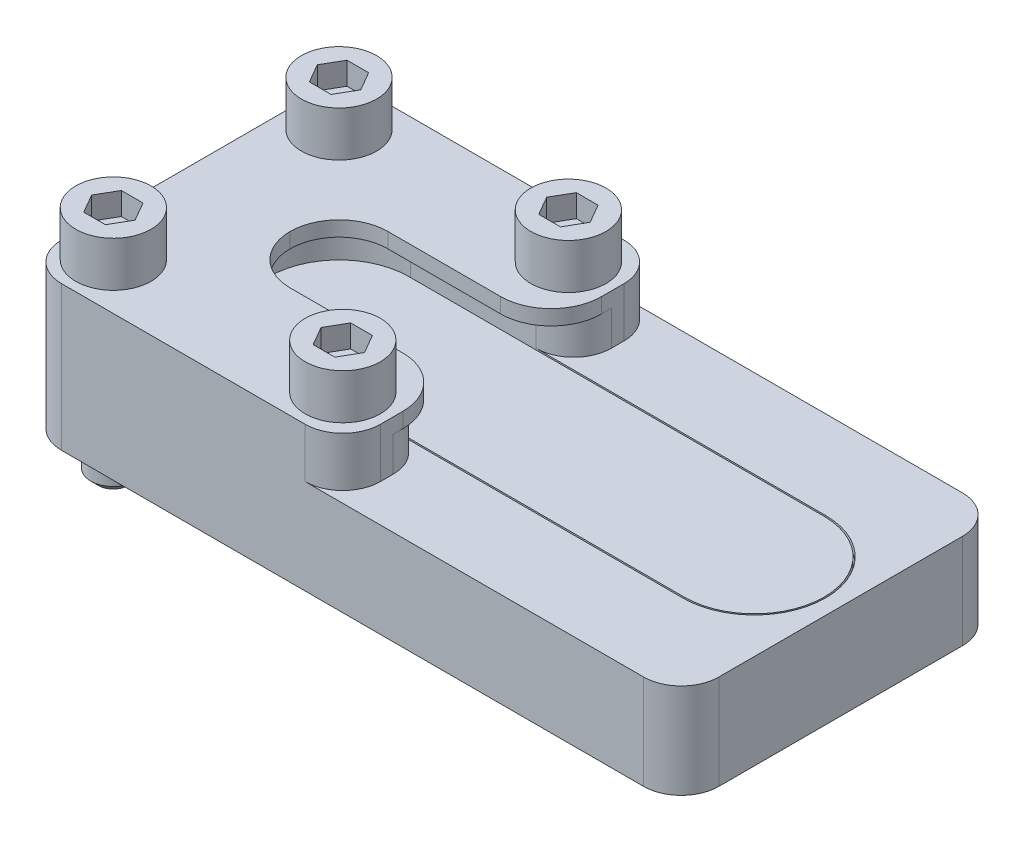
ISO-10303-21;
HEADER;
FILE_DESCRIPTION(('STEP AP214'),'2;1');
FILE_NAME('part.step','',(''),(''),'','','');
FILE_SCHEMA(('AUTOMOTIVE_DESIGN { 1 0 10303 214 1 1 1 1 }'));
ENDSEC;
DATA;
#1=APPLICATION_CONTEXT('core data for automotive mechanical design processes');
#2=APPLICATION_PROTOCOL_DEFINITION('international standard','automotive_design',2000,#1);
#3=PRODUCT_CONTEXT('',#1,'mechanical');
#4=PRODUCT('Part','Part','',(#3));
#5=PRODUCT_RELATED_PRODUCT_CATEGORY('part','',(#4));
#6=PRODUCT_DEFINITION_FORMATION('','',#4);
#7=PRODUCT_DEFINITION_CONTEXT('part definition',#1,'design');
#8=PRODUCT_DEFINITION('design','',#6,#7);
#9=PRODUCT_DEFINITION_SHAPE('','',#8);
#10=(LENGTH_UNIT() NAMED_UNIT(*) SI_UNIT(.MILLI.,.METRE.));
#11=(NAMED_UNIT(*) PLANE_ANGLE_UNIT() SI_UNIT($,.RADIAN.));
#12=(NAMED_UNIT(*) SI_UNIT($,.STERADIAN.) SOLID_ANGLE_UNIT());
#13=UNCERTAINTY_MEASURE_WITH_UNIT(LENGTH_MEASURE(1.E-05),#10,'distance_accuracy_value','');
#14=(GEOMETRIC_REPRESENTATION_CONTEXT(3) GLOBAL_UNCERTAINTY_ASSIGNED_CONTEXT((#13)) GLOBAL_UNIT_ASSIGNED_CONTEXT((#10,
#11,#12)) REPRESENTATION_CONTEXT('',''));
#15=CARTESIAN_POINT('',(0.,0.,0.));
#16=DIRECTION('',(0.,0.,1.));
#17=DIRECTION('',(1.,0.,0.));
#18=AXIS2_PLACEMENT_3D('',#15,#16,#17);
#19=CARTESIAN_POINT('',(0.,-5.,9.5));
#20=DIRECTION('',(0.,0.,1.));
#21=DIRECTION('',(-1.,0.,0.));
#22=AXIS2_PLACEMENT_3D('',#19,#20,#21);
#23=PLANE('',#22);
#24=DIRECTION('',(-1.,0.,0.));
#25=VECTOR('',#24,1.);
#26=CARTESIAN_POINT('',(0.,-0.399999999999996,9.5));
#27=LINE('',#26,#25);
#28=CARTESIAN_POINT('',(1.7,-0.399999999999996,9.5));
#29=VERTEX_POINT('',#28);
#30=CARTESIAN_POINT('',(-15.,-0.399999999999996,9.5));
#31=VERTEX_POINT('',#30);
#32=EDGE_CURVE('E1042',#29,#31,#27,.T.);
#33=ORIENTED_EDGE('',*,*,#32,.F.);
#34=DIRECTION('',(0.,1.,0.));
#35=VECTOR('',#34,1.);
#36=CARTESIAN_POINT('',(1.7,-5.,9.5));
#37=LINE('',#36,#35);
#38=CARTESIAN_POINT('',(1.7,-5.,9.5));
#39=VERTEX_POINT('',#38);
#40=EDGE_CURVE('E1058',#39,#29,#37,.T.);
#41=ORIENTED_EDGE('',*,*,#40,.F.);
#42=DIRECTION('',(1.,0.,0.));
#43=VECTOR('',#42,1.);
#44=CARTESIAN_POINT('',(-15.,-5.,9.5));
#45=LINE('',#44,#43);
#46=CARTESIAN_POINT('',(40.2,-5.,9.5));
#47=VERTEX_POINT('',#46);
#48=EDGE_CURVE('E1062',#39,#47,#45,.T.);
#49=ORIENTED_EDGE('',*,*,#48,.T.);
#50=DIRECTION('',(0.,1.,0.));
#51=VECTOR('',#50,1.);
#52=CARTESIAN_POINT('',(40.2,-6.,9.5));
#53=LINE('',#52,#51);
#54=CARTESIAN_POINT('',(40.2,-6.,9.5));
#55=VERTEX_POINT('',#54);
#56=EDGE_CURVE('E1136',#55,#47,#53,.T.);
#57=ORIENTED_EDGE('',*,*,#56,.F.);
#58=DIRECTION('',(1.,0.,0.));
#59=VECTOR('',#58,1.);
#60=CARTESIAN_POINT('',(-15.,-6.,9.5));
#61=LINE('',#60,#59);
#62=CARTESIAN_POINT('',(-15.,-6.,9.5));
#63=VERTEX_POINT('',#62);
#64=EDGE_CURVE('E1204',#63,#55,#61,.T.);
#65=ORIENTED_EDGE('',*,*,#64,.F.);
#66=DIRECTION('',(0.,1.,0.));
#67=VECTOR('',#66,1.);
#68=CARTESIAN_POINT('',(-15.,-5.,9.5));
#69=LINE('',#68,#67);
#70=EDGE_CURVE('E1069',#63,#31,#69,.T.);
#71=ORIENTED_EDGE('',*,*,#70,.T.);
#72=EDGE_LOOP('',(#33,#41,#49,#57,#65,#71));
#73=FACE_BOUND('',#72,.T.);
#74=ADVANCED_FACE('F17',(#73),#23,.F.);
#75=CARTESIAN_POINT('',(1.7,-5.,14.5));
#76=DIRECTION('',(0.,1.,0.));
#77=DIRECTION('',(0.,0.,-1.));
#78=AXIS2_PLACEMENT_3D('',#75,#76,#77);
#79=CYLINDRICAL_SURFACE('',#78,5.);
#80=ORIENTED_EDGE('',*,*,#40,.T.);
#81=CARTESIAN_POINT('',(1.7,-0.399999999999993,14.5));
#82=DIRECTION('',(0.,1.,0.));
#83=DIRECTION('',(0.,0.,-1.));
#84=AXIS2_PLACEMENT_3D('',#81,#82,#83);
#85=CIRCLE('',#84,5.);
#86=CARTESIAN_POINT('',(6.7,-0.399999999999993,14.5));
#87=VERTEX_POINT('',#86);
#88=EDGE_CURVE('E1040',#29,#87,#85,.F.);
#89=ORIENTED_EDGE('',*,*,#88,.T.);
#90=DIRECTION('',(0.,1.,0.));
#91=VECTOR('',#90,1.);
#92=CARTESIAN_POINT('',(6.7,-5.,14.5));
#93=LINE('',#92,#91);
#94=CARTESIAN_POINT('',(6.7,-5.,14.5));
#95=VERTEX_POINT('',#94);
#96=EDGE_CURVE('E1080',#95,#87,#93,.T.);
#97=ORIENTED_EDGE('',*,*,#96,.F.);
#98=CARTESIAN_POINT('',(1.7,-5.,14.5));
#99=DIRECTION('',(0.,-1.,0.));
#100=DIRECTION('',(0.,0.,1.));
#101=AXIS2_PLACEMENT_3D('',#98,#99,#100);
#102=CIRCLE('',#101,5.);
#103=EDGE_CURVE('E1063',#39,#95,#102,.T.);
#104=ORIENTED_EDGE('',*,*,#103,.F.);
#105=EDGE_LOOP('',(#80,#89,#97,#104));
#106=FACE_BOUND('',#105,.T.);
#107=ADVANCED_FACE('F1395',(#106),#79,.T.);
#108=CARTESIAN_POINT('',(6.7,-5.,16.2));
#109=DIRECTION('',(-1.,0.,0.));
#110=DIRECTION('',(0.,0.,-1.));
#111=AXIS2_PLACEMENT_3D('',#108,#109,#110);
#112=PLANE('',#111);
#113=ORIENTED_EDGE('',*,*,#96,.T.);
#114=DIRECTION('',(0.,0.,-1.));
#115=VECTOR('',#114,1.);
#116=CARTESIAN_POINT('',(6.7,-0.4,0.));
#117=LINE('',#116,#115);
#118=CARTESIAN_POINT('',(6.7,-0.4,13.2));
#119=VERTEX_POINT('',#118);
#120=EDGE_CURVE('E921',#87,#119,#117,.T.);
#121=ORIENTED_EDGE('',*,*,#120,.T.);
#122=DIRECTION('',(0.,-1.,0.));
#123=VECTOR('',#122,1.);
#124=CARTESIAN_POINT('',(6.7,1.6,13.2));
#125=LINE('',#124,#123);
#126=CARTESIAN_POINT('',(6.7,1.6,13.2));
#127=VERTEX_POINT('',#126);
#128=EDGE_CURVE('E853',#127,#119,#125,.T.);
#129=ORIENTED_EDGE('',*,*,#128,.F.);
#130=DIRECTION('',(0.,0.,-1.));
#131=VECTOR('',#130,1.);
#132=CARTESIAN_POINT('',(6.7,1.6,0.));
#133=LINE('',#132,#131);
#134=CARTESIAN_POINT('',(6.7,1.6,16.2));
#135=VERTEX_POINT('',#134);
#136=EDGE_CURVE('E848',#135,#127,#133,.T.);
#137=ORIENTED_EDGE('',*,*,#136,.F.);
#138=DIRECTION('',(0.,1.,0.));
#139=VECTOR('',#138,1.);
#140=CARTESIAN_POINT('',(6.7,-5.,16.2));
#141=LINE('',#140,#139);
#142=CARTESIAN_POINT('',(6.7,-5.,16.2));
#143=VERTEX_POINT('',#142);
#144=EDGE_CURVE('E1171',#143,#135,#141,.T.);
#145=ORIENTED_EDGE('',*,*,#144,.F.);
#146=DIRECTION('',(0.,0.,1.));
#147=VECTOR('',#146,1.);
#148=CARTESIAN_POINT('',(6.7,-5.,16.2));
#149=LINE('',#148,#147);
#150=EDGE_CURVE('E1084',#95,#143,#149,.T.);
#151=ORIENTED_EDGE('',*,*,#150,.F.);
#152=EDGE_LOOP('',(#113,#121,#129,#137,#145,#151));
#153=FACE_BOUND('',#152,.T.);
#154=ADVANCED_FACE('F1348',(#153),#112,.F.);
#155=CARTESIAN_POINT('',(1.7,-5.,16.2));
#156=DIRECTION('',(0.,1.,0.));
#157=DIRECTION('',(0.,0.,-1.));
#158=AXIS2_PLACEMENT_3D('',#155,#156,#157);
#159=CYLINDRICAL_SURFACE('',#158,5.);
#160=ORIENTED_EDGE('',*,*,#144,.T.);
#161=CARTESIAN_POINT('',(1.7,1.6,16.2));
#162=DIRECTION('',(0.,1.,0.));
#163=DIRECTION('',(1.,0.,0.));
#164=AXIS2_PLACEMENT_3D('',#161,#162,#163);
#165=CIRCLE('',#164,5.);
#166=CARTESIAN_POINT('',(1.7,1.6,21.2));
#167=VERTEX_POINT('',#166);
#168=EDGE_CURVE('E868',#167,#135,#165,.T.);
#169=ORIENTED_EDGE('',*,*,#168,.F.);
#170=DIRECTION('',(0.,1.,0.));
#171=VECTOR('',#170,1.);
#172=CARTESIAN_POINT('',(1.7,-5.,21.2));
#173=LINE('',#172,#171);
#174=CARTESIAN_POINT('',(1.7,-5.,21.2));
#175=VERTEX_POINT('',#174);
#176=EDGE_CURVE('E1155',#175,#167,#173,.T.);
#177=ORIENTED_EDGE('',*,*,#176,.F.);
#178=CARTESIAN_POINT('',(1.7,-5.,16.2));
#179=DIRECTION('',(0.,-1.,0.));
#180=DIRECTION('',(0.,0.,-1.));
#181=AXIS2_PLACEMENT_3D('',#178,#179,#180);
#182=CIRCLE('',#181,5.);
#183=EDGE_CURVE('E1197',#143,#175,#182,.T.);
#184=ORIENTED_EDGE('',*,*,#183,.F.);
#185=EDGE_LOOP('',(#160,#169,#177,#184));
#186=FACE_BOUND('',#185,.T.);
#187=ADVANCED_FACE('F1340',(#186),#159,.T.);
#188=CARTESIAN_POINT('',(1.7,-5.,-16.2));
#189=DIRECTION('',(0.,1.,0.));
#190=DIRECTION('',(0.,0.,-1.));
#191=AXIS2_PLACEMENT_3D('',#188,#189,#190);
#192=CYLINDRICAL_SURFACE('',#191,5.);
#193=DIRECTION('',(0.,1.,0.));
#194=VECTOR('',#193,1.);
#195=CARTESIAN_POINT('',(1.7,-5.,-21.2));
#196=LINE('',#195,#194);
#197=CARTESIAN_POINT('',(1.7,-5.,-21.2));
#198=VERTEX_POINT('',#197);
#199=CARTESIAN_POINT('',(1.7,1.6,-21.2));
#200=VERTEX_POINT('',#199);
#201=EDGE_CURVE('E1179',#198,#200,#196,.T.);
#202=ORIENTED_EDGE('',*,*,#201,.T.);
#203=CARTESIAN_POINT('',(1.7,1.6,-16.2));
#204=DIRECTION('',(0.,-1.,0.));
#205=DIRECTION('',(1.,0.,0.));
#206=AXIS2_PLACEMENT_3D('',#203,#204,#205);
#207=CIRCLE('',#206,5.);
#208=CARTESIAN_POINT('',(6.7,1.6,-16.2));
#209=VERTEX_POINT('',#208);
#210=EDGE_CURVE('E939',#200,#209,#207,.T.);
#211=ORIENTED_EDGE('',*,*,#210,.T.);
#212=DIRECTION('',(0.,1.,0.));
#213=VECTOR('',#212,1.);
#214=CARTESIAN_POINT('',(6.7,-5.,-16.2));
#215=LINE('',#214,#213);
#216=CARTESIAN_POINT('',(6.7,-5.,-16.2));
#217=VERTEX_POINT('',#216);
#218=EDGE_CURVE('E1203',#217,#209,#215,.T.);
#219=ORIENTED_EDGE('',*,*,#218,.F.);
#220=CARTESIAN_POINT('',(1.7,-5.,-16.2));
#221=DIRECTION('',(0.,-1.,0.));
#222=DIRECTION('',(0.,0.,-1.));
#223=AXIS2_PLACEMENT_3D('',#220,#221,#222);
#224=CIRCLE('',#223,5.);
#225=EDGE_CURVE('E1238',#198,#217,#224,.T.);
#226=ORIENTED_EDGE('',*,*,#225,.F.);
#227=EDGE_LOOP('',(#202,#211,#219,#226));
#228=FACE_BOUND('',#227,.T.);
#229=ADVANCED_FACE('F1331',(#228),#192,.T.);
#230=CARTESIAN_POINT('',(6.7,-5.,-16.2));
#231=DIRECTION('',(-1.,0.,0.));
#232=DIRECTION('',(0.,0.,-1.));
#233=AXIS2_PLACEMENT_3D('',#230,#231,#232);
#234=PLANE('',#233);
#235=ORIENTED_EDGE('',*,*,#218,.T.);
#236=DIRECTION('',(0.,0.,1.));
#237=VECTOR('',#236,1.);
#238=CARTESIAN_POINT('',(6.7,1.6,0.));
#239=LINE('',#238,#237);
#240=CARTESIAN_POINT('',(6.7,1.6,-13.2));
#241=VERTEX_POINT('',#240);
#242=EDGE_CURVE('E925',#209,#241,#239,.T.);
#243=ORIENTED_EDGE('',*,*,#242,.T.);
#244=DIRECTION('',(0.,-1.,0.));
#245=VECTOR('',#244,1.);
#246=CARTESIAN_POINT('',(6.7,1.6,-13.2));
#247=LINE('',#246,#245);
#248=CARTESIAN_POINT('',(6.7,-0.4,-13.2));
#249=VERTEX_POINT('',#248);
#250=EDGE_CURVE('E874',#241,#249,#247,.T.);
#251=ORIENTED_EDGE('',*,*,#250,.T.);
#252=DIRECTION('',(0.,0.,1.));
#253=VECTOR('',#252,1.);
#254=CARTESIAN_POINT('',(6.7,-0.4,0.));
#255=LINE('',#254,#253);
#256=CARTESIAN_POINT('',(6.7,-0.400000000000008,-14.5));
#257=VERTEX_POINT('',#256);
#258=EDGE_CURVE('E922',#257,#249,#255,.T.);
#259=ORIENTED_EDGE('',*,*,#258,.F.);
#260=DIRECTION('',(0.,1.,0.));
#261=VECTOR('',#260,1.);
#262=CARTESIAN_POINT('',(6.7,-5.,-14.5));
#263=LINE('',#262,#261);
#264=CARTESIAN_POINT('',(6.7,-5.,-14.5));
#265=VERTEX_POINT('',#264);
#266=EDGE_CURVE('E1102',#265,#257,#263,.T.);
#267=ORIENTED_EDGE('',*,*,#266,.F.);
#268=DIRECTION('',(0.,0.,1.));
#269=VECTOR('',#268,1.);
#270=CARTESIAN_POINT('',(6.7,-5.,-16.2));
#271=LINE('',#270,#269);
#272=EDGE_CURVE('E1105',#217,#265,#271,.T.);
#273=ORIENTED_EDGE('',*,*,#272,.F.);
#274=EDGE_LOOP('',(#235,#243,#251,#259,#267,#273));
#275=FACE_BOUND('',#274,.T.);
#276=ADVANCED_FACE('F1373',(#275),#234,.F.);
#277=CARTESIAN_POINT('',(1.7,-5.,-14.5));
#278=DIRECTION('',(0.,1.,0.));
#279=DIRECTION('',(0.,0.,-1.));
#280=AXIS2_PLACEMENT_3D('',#277,#278,#279);
#281=CYLINDRICAL_SURFACE('',#280,5.);
#282=ORIENTED_EDGE('',*,*,#266,.T.);
#283=CARTESIAN_POINT('',(1.7,-0.400000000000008,-14.5));
#284=DIRECTION('',(0.,1.,0.));
#285=DIRECTION('',(0.,0.,-1.));
#286=AXIS2_PLACEMENT_3D('',#283,#284,#285);
#287=CIRCLE('',#286,5.);
#288=CARTESIAN_POINT('',(1.7,-0.400000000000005,-9.5));
#289=VERTEX_POINT('',#288);
#290=EDGE_CURVE('E1038',#257,#289,#287,.F.);
#291=ORIENTED_EDGE('',*,*,#290,.T.);
#292=DIRECTION('',(0.,1.,0.));
#293=VECTOR('',#292,1.);
#294=CARTESIAN_POINT('',(1.7,-5.,-9.5));
#295=LINE('',#294,#293);
#296=CARTESIAN_POINT('',(1.7,-5.,-9.5));
#297=VERTEX_POINT('',#296);
#298=EDGE_CURVE('E1119',#297,#289,#295,.T.);
#299=ORIENTED_EDGE('',*,*,#298,.F.);
#300=CARTESIAN_POINT('',(1.7,-5.,-14.5));
#301=DIRECTION('',(0.,-1.,0.));
#302=DIRECTION('',(0.,0.,-1.));
#303=AXIS2_PLACEMENT_3D('',#300,#301,#302);
#304=CIRCLE('',#303,5.);
#305=EDGE_CURVE('E1106',#265,#297,#304,.T.);
#306=ORIENTED_EDGE('',*,*,#305,.F.);
#307=EDGE_LOOP('',(#282,#291,#299,#306));
#308=FACE_BOUND('',#307,.T.);
#309=ADVANCED_FACE('F1378',(#308),#281,.T.);
#310=CARTESIAN_POINT('',(-15.,-5.,-9.5));
#311=DIRECTION('',(0.,0.,-1.));
#312=DIRECTION('',(-1.,0.,0.));
#313=AXIS2_PLACEMENT_3D('',#310,#311,#312);
#314=PLANE('',#313);
#315=DIRECTION('',(1.,0.,0.));
#316=VECTOR('',#315,1.);
#317=CARTESIAN_POINT('',(-15.,-0.400000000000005,-9.5));
#318=LINE('',#317,#316);
#319=CARTESIAN_POINT('',(-15.,-0.400000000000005,-9.5));
#320=VERTEX_POINT('',#319);
#321=EDGE_CURVE('E1048',#320,#289,#318,.T.);
#322=ORIENTED_EDGE('',*,*,#321,.F.);
#323=DIRECTION('',(0.,1.,0.));
#324=VECTOR('',#323,1.);
#325=CARTESIAN_POINT('',(-15.,-5.,-9.5));
#326=LINE('',#325,#324);
#327=CARTESIAN_POINT('',(-15.,-6.,-9.5));
#328=VERTEX_POINT('',#327);
#329=EDGE_CURVE('E1079',#328,#320,#326,.T.);
#330=ORIENTED_EDGE('',*,*,#329,.F.);
#331=DIRECTION('',(-1.,0.,0.));
#332=VECTOR('',#331,1.);
#333=CARTESIAN_POINT('',(1.7,-6.,-9.5));
#334=LINE('',#333,#332);
#335=CARTESIAN_POINT('',(40.2,-6.,-9.5));
#336=VERTEX_POINT('',#335);
#337=EDGE_CURVE('E1075',#336,#328,#334,.T.);
#338=ORIENTED_EDGE('',*,*,#337,.F.);
#339=DIRECTION('',(0.,1.,0.));
#340=VECTOR('',#339,1.);
#341=CARTESIAN_POINT('',(40.2,-6.,-9.5));
#342=LINE('',#341,#340);
#343=CARTESIAN_POINT('',(40.2,-5.,-9.5));
#344=VERTEX_POINT('',#343);
#345=EDGE_CURVE('E1078',#336,#344,#342,.T.);
#346=ORIENTED_EDGE('',*,*,#345,.T.);
#347=DIRECTION('',(-1.,0.,0.));
#348=VECTOR('',#347,1.);
#349=CARTESIAN_POINT('',(1.7,-5.,-9.5));
#350=LINE('',#349,#348);
#351=EDGE_CURVE('E1132',#344,#297,#350,.T.);
#352=ORIENTED_EDGE('',*,*,#351,.T.);
#353=ORIENTED_EDGE('',*,*,#298,.T.);
#354=EDGE_LOOP('',(#322,#330,#338,#346,#352,#353));
#355=FACE_BOUND('',#354,.T.);
#356=ADVANCED_FACE('F1382',(#355),#314,.F.);
#357=CARTESIAN_POINT('',(-15.,-5.,0.));
#358=DIRECTION('',(0.,1.,0.));
#359=DIRECTION('',(0.,0.,-1.));
#360=AXIS2_PLACEMENT_3D('',#357,#358,#359);
#361=CYLINDRICAL_SURFACE('',#360,9.5);
#362=CARTESIAN_POINT('',(-15.,-0.4,0.));
#363=DIRECTION('',(0.,1.,0.));
#364=DIRECTION('',(0.,0.,-1.));
#365=AXIS2_PLACEMENT_3D('',#362,#363,#364);
#366=CIRCLE('',#365,9.5);
#367=EDGE_CURVE('E1045',#31,#320,#366,.F.);
#368=ORIENTED_EDGE('',*,*,#367,.F.);
#369=ORIENTED_EDGE('',*,*,#70,.F.);
#370=CARTESIAN_POINT('',(-15.,-6.,0.));
#371=DIRECTION('',(0.,1.,0.));
#372=DIRECTION('',(0.,0.,-1.));
#373=AXIS2_PLACEMENT_3D('',#370,#371,#372);
#374=CIRCLE('',#373,9.5);
#375=EDGE_CURVE('E1073',#328,#63,#374,.T.);
#376=ORIENTED_EDGE('',*,*,#375,.F.);
#377=ORIENTED_EDGE('',*,*,#329,.T.);
#378=EDGE_LOOP('',(#368,#369,#376,#377));
#379=FACE_BOUND('',#378,.T.);
#380=ADVANCED_FACE('F1401',(#379),#361,.F.);
#381=CARTESIAN_POINT('',(-35.7,-17.6,16.2));
#382=DIRECTION('',(-1.,0.,0.));
#383=DIRECTION('',(0.,0.,-1.));
#384=AXIS2_PLACEMENT_3D('',#381,#382,#383);
#385=PLANE('',#384);
#386=DIRECTION('',(0.,1.,0.));
#387=VECTOR('',#386,1.);
#388=CARTESIAN_POINT('',(-35.7,-17.6,16.2));
#389=LINE('',#388,#387);
#390=CARTESIAN_POINT('',(-35.7,-17.6,16.2));
#391=VERTEX_POINT('',#390);
#392=CARTESIAN_POINT('',(-35.7,1.6,16.2));
#393=VERTEX_POINT('',#392);
#394=EDGE_CURVE('E1140',#391,#393,#389,.T.);
#395=ORIENTED_EDGE('',*,*,#394,.T.);
#396=DIRECTION('',(0.,0.,-1.));
#397=VECTOR('',#396,1.);
#398=CARTESIAN_POINT('',(-35.7,1.6,0.));
#399=LINE('',#398,#397);
#400=CARTESIAN_POINT('',(-35.7,1.6,-16.2));
#401=VERTEX_POINT('',#400);
#402=EDGE_CURVE('E858',#393,#401,#399,.T.);
#403=ORIENTED_EDGE('',*,*,#402,.T.);
#404=DIRECTION('',(0.,1.,0.));
#405=VECTOR('',#404,1.);
#406=CARTESIAN_POINT('',(-35.7,-17.6,-16.2));
#407=LINE('',#406,#405);
#408=CARTESIAN_POINT('',(-35.7,-17.6,-16.2));
#409=VERTEX_POINT('',#408);
#410=EDGE_CURVE('E1152',#409,#401,#407,.T.);
#411=ORIENTED_EDGE('',*,*,#410,.F.);
#412=DIRECTION('',(0.,0.,1.));
#413=VECTOR('',#412,1.);
#414=CARTESIAN_POINT('',(-35.7,-17.6,16.2));
#415=LINE('',#414,#413);
#416=EDGE_CURVE('E1172',#409,#391,#415,.T.);
#417=ORIENTED_EDGE('',*,*,#416,.T.);
#418=EDGE_LOOP('',(#395,#403,#411,#417));
#419=FACE_BOUND('',#418,.T.);
#420=ADVANCED_FACE('F1324',(#419),#385,.T.);
#421=CARTESIAN_POINT('',(-30.7,-17.6,16.2));
#422=DIRECTION('',(0.,1.,0.));
#423=DIRECTION('',(0.,0.,-1.));
#424=AXIS2_PLACEMENT_3D('',#421,#422,#423);
#425=CYLINDRICAL_SURFACE('',#424,5.);
#426=DIRECTION('',(0.,1.,0.));
#427=VECTOR('',#426,1.);
#428=CARTESIAN_POINT('',(-30.7,-17.6,21.2));
#429=LINE('',#428,#427);
#430=CARTESIAN_POINT('',(-30.7,-17.6,21.2));
#431=VERTEX_POINT('',#430);
#432=CARTESIAN_POINT('',(-30.7,1.6,21.2));
#433=VERTEX_POINT('',#432);
#434=EDGE_CURVE('E1157',#431,#433,#429,.T.);
#435=ORIENTED_EDGE('',*,*,#434,.T.);
#436=CARTESIAN_POINT('',(-30.7,1.6,16.2));
#437=DIRECTION('',(0.,-1.,0.));
#438=DIRECTION('',(1.,0.,0.));
#439=AXIS2_PLACEMENT_3D('',#436,#437,#438);
#440=CIRCLE('',#439,5.);
#441=EDGE_CURVE('E909',#433,#393,#440,.T.);
#442=ORIENTED_EDGE('',*,*,#441,.T.);
#443=ORIENTED_EDGE('',*,*,#394,.F.);
#444=CARTESIAN_POINT('',(-30.7,-17.6,16.2));
#445=DIRECTION('',(0.,1.,0.));
#446=DIRECTION('',(0.,0.,-1.));
#447=AXIS2_PLACEMENT_3D('',#444,#445,#446);
#448=CIRCLE('',#447,5.);
#449=EDGE_CURVE('E1144',#391,#431,#448,.T.);
#450=ORIENTED_EDGE('',*,*,#449,.T.);
#451=EDGE_LOOP('',(#435,#442,#443,#450));
#452=FACE_BOUND('',#451,.T.);
#453=ADVANCED_FACE('F1320',(#452),#425,.T.);
#454=CARTESIAN_POINT('',(1.7,-17.6,21.2));
#455=DIRECTION('',(0.,0.,1.));
#456=DIRECTION('',(-1.,0.,0.));
#457=AXIS2_PLACEMENT_3D('',#454,#455,#456);
#458=PLANE('',#457);
#459=ORIENTED_EDGE('',*,*,#176,.T.);
#460=DIRECTION('',(-1.,0.,0.));
#461=VECTOR('',#460,1.);
#462=CARTESIAN_POINT('',(0.,1.6,21.2));
#463=LINE('',#462,#461);
#464=EDGE_CURVE('E864',#167,#433,#463,.T.);
#465=ORIENTED_EDGE('',*,*,#464,.T.);
#466=ORIENTED_EDGE('',*,*,#434,.F.);
#467=DIRECTION('',(1.,0.,0.));
#468=VECTOR('',#467,1.);
#469=CARTESIAN_POINT('',(1.7,-17.6,21.2));
#470=LINE('',#469,#468);
#471=CARTESIAN_POINT('',(46.7,-17.6,21.2));
#472=VERTEX_POINT('',#471);
#473=EDGE_CURVE('E1141',#431,#472,#470,.T.);
#474=ORIENTED_EDGE('',*,*,#473,.T.);
#475=DIRECTION('',(0.,1.,0.));
#476=VECTOR('',#475,1.);
#477=CARTESIAN_POINT('',(46.7,-17.6,21.2));
#478=LINE('',#477,#476);
#479=CARTESIAN_POINT('',(46.7,-5.,21.2));
#480=VERTEX_POINT('',#479);
#481=EDGE_CURVE('E1124',#472,#480,#478,.T.);
#482=ORIENTED_EDGE('',*,*,#481,.T.);
#483=DIRECTION('',(1.,0.,0.));
#484=VECTOR('',#483,1.);
#485=CARTESIAN_POINT('',(101.7,-5.,21.2));
#486=LINE('',#485,#484);
#487=EDGE_CURVE('E1137',#175,#480,#486,.T.);
#488=ORIENTED_EDGE('',*,*,#487,.F.);
#489=EDGE_LOOP('',(#459,#465,#466,#474,#482,#488));
#490=FACE_BOUND('',#489,.T.);
#491=ADVANCED_FACE('F1315',(#490),#458,.T.);
#492=CARTESIAN_POINT('',(-30.7,-17.6,-16.2));
#493=DIRECTION('',(0.,1.,0.));
#494=DIRECTION('',(0.,0.,-1.));
#495=AXIS2_PLACEMENT_3D('',#492,#493,#494);
#496=CYLINDRICAL_SURFACE('',#495,5.);
#497=ORIENTED_EDGE('',*,*,#410,.T.);
#498=CARTESIAN_POINT('',(-30.7,1.6,-16.2));
#499=DIRECTION('',(0.,-1.,0.));
#500=DIRECTION('',(1.,0.,0.));
#501=AXIS2_PLACEMENT_3D('',#498,#499,#500);
#502=CIRCLE('',#501,5.);
#503=CARTESIAN_POINT('',(-30.7,1.6,-21.2));
#504=VERTEX_POINT('',#503);
#505=EDGE_CURVE('E863',#401,#504,#502,.T.);
#506=ORIENTED_EDGE('',*,*,#505,.T.);
#507=DIRECTION('',(0.,1.,0.));
#508=VECTOR('',#507,1.);
#509=CARTESIAN_POINT('',(-30.7,-17.6,-21.2));
#510=LINE('',#509,#508);
#511=CARTESIAN_POINT('',(-30.7,-17.6,-21.2));
#512=VERTEX_POINT('',#511);
#513=EDGE_CURVE('E1180',#512,#504,#510,.T.);
#514=ORIENTED_EDGE('',*,*,#513,.F.);
#515=CARTESIAN_POINT('',(-30.7,-17.6,-16.2));
#516=DIRECTION('',(0.,1.,0.));
#517=DIRECTION('',(0.,0.,-1.));
#518=AXIS2_PLACEMENT_3D('',#515,#516,#517);
#519=CIRCLE('',#518,5.);
#520=EDGE_CURVE('E1156',#512,#409,#519,.T.);
#521=ORIENTED_EDGE('',*,*,#520,.T.);
#522=EDGE_LOOP('',(#497,#506,#514,#521));
#523=FACE_BOUND('',#522,.T.);
#524=ADVANCED_FACE('F1295',(#523),#496,.T.);
#525=CARTESIAN_POINT('',(-30.7,-17.6,-21.2));
#526=DIRECTION('',(0.,0.,-1.));
#527=DIRECTION('',(1.,0.,0.));
#528=AXIS2_PLACEMENT_3D('',#525,#526,#527);
#529=PLANE('',#528);
#530=ORIENTED_EDGE('',*,*,#513,.T.);
#531=DIRECTION('',(1.,0.,0.));
#532=VECTOR('',#531,1.);
#533=CARTESIAN_POINT('',(0.,1.6,-21.2));
#534=LINE('',#533,#532);
#535=EDGE_CURVE('E935',#504,#200,#534,.T.);
#536=ORIENTED_EDGE('',*,*,#535,.T.);
#537=ORIENTED_EDGE('',*,*,#201,.F.);
#538=DIRECTION('',(-1.,0.,0.));
#539=VECTOR('',#538,1.);
#540=CARTESIAN_POINT('',(1.7,-5.,-21.2));
#541=LINE('',#540,#539);
#542=CARTESIAN_POINT('',(46.7,-5.,-21.2));
#543=VERTEX_POINT('',#542);
#544=EDGE_CURVE('E1057',#543,#198,#541,.T.);
#545=ORIENTED_EDGE('',*,*,#544,.F.);
#546=DIRECTION('',(0.,1.,0.));
#547=VECTOR('',#546,1.);
#548=CARTESIAN_POINT('',(46.7,-17.6,-21.2));
#549=LINE('',#548,#547);
#550=CARTESIAN_POINT('',(46.7,-17.6,-21.2));
#551=VERTEX_POINT('',#550);
#552=EDGE_CURVE('E1052',#551,#543,#549,.T.);
#553=ORIENTED_EDGE('',*,*,#552,.F.);
#554=DIRECTION('',(-1.,0.,0.));
#555=VECTOR('',#554,1.);
#556=CARTESIAN_POINT('',(46.7,-17.6,-21.2));
#557=LINE('',#556,#555);
#558=EDGE_CURVE('E1056',#551,#512,#557,.T.);
#559=ORIENTED_EDGE('',*,*,#558,.T.);
#560=EDGE_LOOP('',(#530,#536,#537,#545,#553,#559));
#561=FACE_BOUND('',#560,.T.);
#562=ADVANCED_FACE('F1299',(#561),#529,.T.);
#563=CARTESIAN_POINT('',(-30.,-17.6,15.));
#564=DIRECTION('',(0.,1.,0.));
#565=DIRECTION('',(0.,0.,-1.));
#566=AXIS2_PLACEMENT_3D('',#563,#564,#565);
#567=CYLINDRICAL_SURFACE('',#566,3.2);
#568=DIRECTION('',(0.,-1.,0.));
#569=VECTOR('',#568,1.);
#570=CARTESIAN_POINT('',(-33.2,1.6,15.));
#571=LINE('',#570,#569);
#572=CARTESIAN_POINT('',(-33.2,1.6,15.));
#573=VERTEX_POINT('',#572);
#574=CARTESIAN_POINT('',(-33.2,-0.399999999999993,15.));
#575=VERTEX_POINT('',#574);
#576=EDGE_CURVE('E934',#573,#575,#571,.T.);
#577=ORIENTED_EDGE('',*,*,#576,.T.);
#578=ORIENTED_EDGE('',*,*,#576,.F.);
#579=CARTESIAN_POINT('',(-30.,1.6,15.));
#580=DIRECTION('',(0.,-1.,0.));
#581=DIRECTION('',(1.,0.,0.));
#582=AXIS2_PLACEMENT_3D('',#579,#580,#581);
#583=CIRCLE('',#582,3.2);
#584=CARTESIAN_POINT('',(-26.8,1.6,15.));
#585=VERTEX_POINT('',#584);
#586=EDGE_CURVE('E889',#585,#573,#583,.T.);
#587=ORIENTED_EDGE('',*,*,#586,.F.);
#588=DIRECTION('',(0.,-1.,0.));
#589=VECTOR('',#588,1.);
#590=CARTESIAN_POINT('',(-26.8,1.6,15.));
#591=LINE('',#590,#589);
#592=CARTESIAN_POINT('',(-26.8,-0.399999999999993,15.));
#593=VERTEX_POINT('',#592);
#594=EDGE_CURVE('E965',#585,#593,#591,.T.);
#595=ORIENTED_EDGE('',*,*,#594,.T.);
#596=ORIENTED_EDGE('',*,*,#594,.F.);
#597=CARTESIAN_POINT('',(-30.,1.6,15.));
#598=DIRECTION('',(0.,-1.,0.));
#599=DIRECTION('',(1.,0.,0.));
#600=AXIS2_PLACEMENT_3D('',#597,#598,#599);
#601=CIRCLE('',#600,3.2);
#602=EDGE_CURVE('E902',#573,#585,#601,.T.);
#603=ORIENTED_EDGE('',*,*,#602,.F.);
#604=EDGE_LOOP('',(#577,#578,#587,#595,#596,#603));
#605=FACE_BOUND('',#604,.T.);
#606=DIRECTION('',(0.,1.,0.));
#607=VECTOR('',#606,1.);
#608=CARTESIAN_POINT('',(-30.,-17.6,18.2));
#609=LINE('',#608,#607);
#610=CARTESIAN_POINT('',(-30.,-17.6,18.2));
#611=VERTEX_POINT('',#610);
#612=CARTESIAN_POINT('',(-30.,-0.4,18.2));
#613=VERTEX_POINT('',#612);
#614=EDGE_CURVE('E1100',#611,#613,#609,.T.);
#615=ORIENTED_EDGE('',*,*,#614,.T.);
#616=ORIENTED_EDGE('',*,*,#614,.F.);
#617=CARTESIAN_POINT('',(-30.,-17.6,15.));
#618=DIRECTION('',(0.,1.,0.));
#619=DIRECTION('',(0.,0.,-1.));
#620=AXIS2_PLACEMENT_3D('',#617,#618,#619);
#621=CIRCLE('',#620,3.2);
#622=CARTESIAN_POINT('',(-30.,-17.6,11.8));
#623=VERTEX_POINT('',#622);
#624=EDGE_CURVE('E1168',#623,#611,#621,.T.);
#625=ORIENTED_EDGE('',*,*,#624,.F.);
#626=DIRECTION('',(0.,1.,0.));
#627=VECTOR('',#626,1.);
#628=CARTESIAN_POINT('',(-30.,-17.6,11.8));
#629=LINE('',#628,#627);
#630=CARTESIAN_POINT('',(-30.,-0.399999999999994,11.8));
#631=VERTEX_POINT('',#630);
#632=EDGE_CURVE('E1223',#623,#631,#629,.T.);
#633=ORIENTED_EDGE('',*,*,#632,.T.);
#634=ORIENTED_EDGE('',*,*,#632,.F.);
#635=CARTESIAN_POINT('',(-30.,-17.6,15.));
#636=DIRECTION('',(0.,1.,0.));
#637=DIRECTION('',(0.,0.,-1.));
#638=AXIS2_PLACEMENT_3D('',#635,#636,#637);
#639=CIRCLE('',#638,3.2);
#640=EDGE_CURVE('E1096',#611,#623,#639,.T.);
#641=ORIENTED_EDGE('',*,*,#640,.F.);
#642=EDGE_LOOP('',(#615,#616,#625,#633,#634,#641));
#643=FACE_BOUND('',#642,.T.);
#644=ADVANCED_FACE('F1412',(#605,#643),#567,.F.);
#645=CARTESIAN_POINT('',(0.5,-17.6,-15.));
#646=DIRECTION('',(0.,1.,0.));
#647=DIRECTION('',(0.,0.,-1.));
#648=AXIS2_PLACEMENT_3D('',#645,#646,#647);
#649=CYLINDRICAL_SURFACE('',#648,3.2);
#650=DIRECTION('',(0.,-1.,0.));
#651=VECTOR('',#650,1.);
#652=CARTESIAN_POINT('',(-2.7,1.6,-15.));
#653=LINE('',#652,#651);
#654=CARTESIAN_POINT('',(-2.7,1.6,-15.));
#655=VERTEX_POINT('',#654);
#656=CARTESIAN_POINT('',(-2.7,-0.400000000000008,-15.));
#657=VERTEX_POINT('',#656);
#658=EDGE_CURVE('E843',#655,#657,#653,.T.);
#659=ORIENTED_EDGE('',*,*,#658,.T.);
#660=ORIENTED_EDGE('',*,*,#658,.F.);
#661=CARTESIAN_POINT('',(0.5,1.6,-15.));
#662=DIRECTION('',(0.,-1.,0.));
#663=DIRECTION('',(1.,0.,0.));
#664=AXIS2_PLACEMENT_3D('',#661,#662,#663);
#665=CIRCLE('',#664,3.2);
#666=CARTESIAN_POINT('',(3.7,1.6,-15.));
#667=VERTEX_POINT('',#666);
#668=EDGE_CURVE('E842',#667,#655,#665,.T.);
#669=ORIENTED_EDGE('',*,*,#668,.F.);
#670=DIRECTION('',(0.,-1.,0.));
#671=VECTOR('',#670,1.);
#672=CARTESIAN_POINT('',(3.7,1.6,-15.));
#673=LINE('',#672,#671);
#674=CARTESIAN_POINT('',(3.7,-0.400000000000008,-15.));
#675=VERTEX_POINT('',#674);
#676=EDGE_CURVE('E847',#667,#675,#673,.T.);
#677=ORIENTED_EDGE('',*,*,#676,.T.);
#678=ORIENTED_EDGE('',*,*,#676,.F.);
#679=CARTESIAN_POINT('',(0.5,1.6,-15.));
#680=DIRECTION('',(0.,-1.,0.));
#681=DIRECTION('',(1.,0.,0.));
#682=AXIS2_PLACEMENT_3D('',#679,#680,#681);
#683=CIRCLE('',#682,3.2);
#684=EDGE_CURVE('E914',#655,#667,#683,.T.);
#685=ORIENTED_EDGE('',*,*,#684,.F.);
#686=EDGE_LOOP('',(#659,#660,#669,#677,#678,#685));
#687=FACE_BOUND('',#686,.T.);
#688=DIRECTION('',(0.,1.,0.));
#689=VECTOR('',#688,1.);
#690=CARTESIAN_POINT('',(0.5,-17.6,-11.8));
#691=LINE('',#690,#689);
#692=CARTESIAN_POINT('',(0.5,-17.6,-11.8));
#693=VERTEX_POINT('',#692);
#694=CARTESIAN_POINT('',(0.5,-0.4,-11.8));
#695=VERTEX_POINT('',#694);
#696=EDGE_CURVE('E1164',#693,#695,#691,.T.);
#697=ORIENTED_EDGE('',*,*,#696,.T.);
#698=ORIENTED_EDGE('',*,*,#696,.F.);
#699=CARTESIAN_POINT('',(0.5,-17.6,-15.));
#700=DIRECTION('',(0.,1.,0.));
#701=DIRECTION('',(0.,0.,-1.));
#702=AXIS2_PLACEMENT_3D('',#699,#700,#701);
#703=CIRCLE('',#702,3.2);
#704=CARTESIAN_POINT('',(0.5,-17.6,-18.2));
#705=VERTEX_POINT('',#704);
#706=EDGE_CURVE('E1175',#705,#693,#703,.T.);
#707=ORIENTED_EDGE('',*,*,#706,.F.);
#708=DIRECTION('',(0.,1.,0.));
#709=VECTOR('',#708,1.);
#710=CARTESIAN_POINT('',(0.5,-17.6,-18.2));
#711=LINE('',#710,#709);
#712=CARTESIAN_POINT('',(0.5,-0.400000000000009,-18.2));
#713=VERTEX_POINT('',#712);
#714=EDGE_CURVE('E1101',#705,#713,#711,.T.);
#715=ORIENTED_EDGE('',*,*,#714,.T.);
#716=ORIENTED_EDGE('',*,*,#714,.F.);
#717=CARTESIAN_POINT('',(0.5,-17.6,-15.));
#718=DIRECTION('',(0.,1.,0.));
#719=DIRECTION('',(0.,0.,-1.));
#720=AXIS2_PLACEMENT_3D('',#717,#718,#719);
#721=CIRCLE('',#720,3.2);
#722=EDGE_CURVE('E1051',#693,#705,#721,.T.);
#723=ORIENTED_EDGE('',*,*,#722,.F.);
#724=EDGE_LOOP('',(#697,#698,#707,#715,#716,#723));
#725=FACE_BOUND('',#724,.T.);
#726=ADVANCED_FACE('F1403',(#687,#725),#649,.F.);
#727=CARTESIAN_POINT('',(-15.,-6.,0.));
#728=DIRECTION('',(0.,1.,0.));
#729=DIRECTION('',(0.,0.,-1.));
#730=AXIS2_PLACEMENT_3D('',#727,#728,#729);
#731=PLANE('',#730);
#732=DIRECTION('',(1.,0.,0.));
#733=VECTOR('',#732,1.);
#734=CARTESIAN_POINT('',(-15.,-6.,9.3));
#735=LINE('',#734,#733);
#736=CARTESIAN_POINT('',(-15.,-6.,9.3));
#737=VERTEX_POINT('',#736);
#738=CARTESIAN_POINT('',(40.2,-6.,9.3));
#739=VERTEX_POINT('',#738);
#740=EDGE_CURVE('E541',#737,#739,#735,.T.);
#741=ORIENTED_EDGE('',*,*,#740,.F.);
#742=CARTESIAN_POINT('',(-15.,-6.,0.));
#743=DIRECTION('',(0.,1.,0.));
#744=DIRECTION('',(0.,0.,-1.));
#745=AXIS2_PLACEMENT_3D('',#742,#743,#744);
#746=CIRCLE('',#745,9.3);
#747=CARTESIAN_POINT('',(-15.,-6.,-9.3));
#748=VERTEX_POINT('',#747);
#749=EDGE_CURVE('E546',#748,#737,#746,.T.);
#750=ORIENTED_EDGE('',*,*,#749,.F.);
#751=DIRECTION('',(-1.,0.,0.));
#752=VECTOR('',#751,1.);
#753=CARTESIAN_POINT('',(40.2,-6.,-9.3));
#754=LINE('',#753,#752);
#755=CARTESIAN_POINT('',(40.2,-6.,-9.3));
#756=VERTEX_POINT('',#755);
#757=EDGE_CURVE('E44',#756,#748,#754,.T.);
#758=ORIENTED_EDGE('',*,*,#757,.F.);
#759=CARTESIAN_POINT('',(40.2,-6.,0.));
#760=DIRECTION('',(0.,1.,0.));
#761=DIRECTION('',(0.,0.,-1.));
#762=AXIS2_PLACEMENT_3D('',#759,#760,#761);
#763=CIRCLE('',#762,9.3);
#764=EDGE_CURVE('E37',#739,#756,#763,.T.);
#765=ORIENTED_EDGE('',*,*,#764,.F.);
#766=EDGE_LOOP('',(#741,#750,#758,#765));
#767=FACE_BOUND('',#766,.T.);
#768=ORIENTED_EDGE('',*,*,#375,.T.);
#769=ORIENTED_EDGE('',*,*,#64,.T.);
#770=CARTESIAN_POINT('',(40.2,-6.,0.));
#771=DIRECTION('',(0.,1.,0.));
#772=DIRECTION('',(0.,0.,-1.));
#773=AXIS2_PLACEMENT_3D('',#770,#771,#772);
#774=CIRCLE('',#773,9.5);
#775=EDGE_CURVE('E1107',#55,#336,#774,.T.);
#776=ORIENTED_EDGE('',*,*,#775,.T.);
#777=ORIENTED_EDGE('',*,*,#337,.T.);
#778=EDGE_LOOP('',(#768,#769,#776,#777));
#779=FACE_BOUND('',#778,.T.);
#780=ADVANCED_FACE('F543',(#767,#779),#731,.T.);
#781=CARTESIAN_POINT('',(40.2,-6.,0.));
#782=DIRECTION('',(0.,1.,0.));
#783=DIRECTION('',(0.,0.,-1.));
#784=AXIS2_PLACEMENT_3D('',#781,#782,#783);
#785=CYLINDRICAL_SURFACE('',#784,9.5);
#786=CARTESIAN_POINT('',(40.2,-5.,0.));
#787=DIRECTION('',(0.,1.,0.));
#788=DIRECTION('',(0.,0.,-1.));
#789=AXIS2_PLACEMENT_3D('',#786,#787,#788);
#790=CIRCLE('',#789,9.5);
#791=EDGE_CURVE('E1110',#47,#344,#790,.T.);
#792=ORIENTED_EDGE('',*,*,#791,.T.);
#793=ORIENTED_EDGE('',*,*,#345,.F.);
#794=ORIENTED_EDGE('',*,*,#775,.F.);
#795=ORIENTED_EDGE('',*,*,#56,.T.);
#796=EDGE_LOOP('',(#792,#793,#794,#795));
#797=FACE_BOUND('',#796,.T.);
#798=ADVANCED_FACE('F1387',(#797),#785,.F.);
#799=CARTESIAN_POINT('',(-30.,0.,-15.));
#800=DIRECTION('',(0.,1.,0.));
#801=DIRECTION('',(0.,0.,-1.));
#802=AXIS2_PLACEMENT_3D('',#799,#800,#801);
#803=CYLINDRICAL_SURFACE('',#802,2.5);
#804=DIRECTION('',(0.,1.,0.));
#805=VECTOR('',#804,1.);
#806=CARTESIAN_POINT('',(-30.,0.,-17.5));
#807=LINE('',#806,#805);
#808=CARTESIAN_POINT('',(-30.,-17.6,-17.5));
#809=VERTEX_POINT('',#808);
#810=CARTESIAN_POINT('',(-30.,-12.9,-17.5));
#811=VERTEX_POINT('',#810);
#812=EDGE_CURVE('E1111',#809,#811,#807,.T.);
#813=ORIENTED_EDGE('',*,*,#812,.T.);
#814=CARTESIAN_POINT('',(-30.,-12.9,-15.));
#815=DIRECTION('',(0.,1.,0.));
#816=DIRECTION('',(0.,0.,1.));
#817=AXIS2_PLACEMENT_3D('',#814,#815,#816);
#818=CIRCLE('',#817,2.5);
#819=CARTESIAN_POINT('',(-30.,-12.9,-12.5));
#820=VERTEX_POINT('',#819);
#821=EDGE_CURVE('E1031',#811,#820,#818,.T.);
#822=ORIENTED_EDGE('',*,*,#821,.T.);
#823=DIRECTION('',(0.,1.,0.));
#824=VECTOR('',#823,1.);
#825=CARTESIAN_POINT('',(-30.,0.,-12.5));
#826=LINE('',#825,#824);
#827=CARTESIAN_POINT('',(-30.,-17.6,-12.5));
#828=VERTEX_POINT('',#827);
#829=EDGE_CURVE('E1116',#828,#820,#826,.T.);
#830=ORIENTED_EDGE('',*,*,#829,.F.);
#831=CARTESIAN_POINT('',(-30.,-17.6,-15.));
#832=DIRECTION('',(0.,1.,0.));
#833=DIRECTION('',(0.,0.,-1.));
#834=AXIS2_PLACEMENT_3D('',#831,#832,#833);
#835=CIRCLE('',#834,2.5);
#836=EDGE_CURVE('E1165',#809,#828,#835,.T.);
#837=ORIENTED_EDGE('',*,*,#836,.F.);
#838=EDGE_LOOP('',(#813,#822,#830,#837));
#839=FACE_BOUND('',#838,.T.);
#840=ADVANCED_FACE('F19',(#839),#803,.F.);
#841=CARTESIAN_POINT('',(0.5,0.,15.));
#842=DIRECTION('',(0.,1.,0.));
#843=DIRECTION('',(0.,0.,-1.));
#844=AXIS2_PLACEMENT_3D('',#841,#842,#843);
#845=CYLINDRICAL_SURFACE('',#844,2.5);
#846=DIRECTION('',(0.,1.,0.));
#847=VECTOR('',#846,1.);
#848=CARTESIAN_POINT('',(0.5,0.,12.5));
#849=LINE('',#848,#847);
#850=CARTESIAN_POINT('',(0.5,-17.6,12.5));
#851=VERTEX_POINT('',#850);
#852=CARTESIAN_POINT('',(0.5,-12.9,12.5));
#853=VERTEX_POINT('',#852);
#854=EDGE_CURVE('E1151',#851,#853,#849,.T.);
#855=ORIENTED_EDGE('',*,*,#854,.T.);
#856=CARTESIAN_POINT('',(0.5,-12.9,15.));
#857=DIRECTION('',(0.,1.,0.));
#858=DIRECTION('',(0.,0.,1.));
#859=AXIS2_PLACEMENT_3D('',#856,#857,#858);
#860=CIRCLE('',#859,2.5);
#861=CARTESIAN_POINT('',(0.5,-12.9,17.5));
#862=VERTEX_POINT('',#861);
#863=EDGE_CURVE('E1034',#853,#862,#860,.T.);
#864=ORIENTED_EDGE('',*,*,#863,.T.);
#865=DIRECTION('',(0.,1.,0.));
#866=VECTOR('',#865,1.);
#867=CARTESIAN_POINT('',(0.5,0.,17.5));
#868=LINE('',#867,#866);
#869=CARTESIAN_POINT('',(0.5,-17.6,17.5));
#870=VERTEX_POINT('',#869);
#871=EDGE_CURVE('E1123',#870,#862,#868,.T.);
#872=ORIENTED_EDGE('',*,*,#871,.F.);
#873=CARTESIAN_POINT('',(0.5,-17.6,15.));
#874=DIRECTION('',(0.,1.,0.));
#875=DIRECTION('',(0.,0.,-1.));
#876=AXIS2_PLACEMENT_3D('',#873,#874,#875);
#877=CIRCLE('',#876,2.5);
#878=EDGE_CURVE('E1074',#851,#870,#877,.T.);
#879=ORIENTED_EDGE('',*,*,#878,.F.);
#880=EDGE_LOOP('',(#855,#864,#872,#879));
#881=FACE_BOUND('',#880,.T.);
#882=ADVANCED_FACE('F1440',(#881),#845,.F.);
#883=CARTESIAN_POINT('',(-15.,-5.,0.));
#884=DIRECTION('',(0.,1.,0.));
#885=DIRECTION('',(0.,0.,-1.));
#886=AXIS2_PLACEMENT_3D('',#883,#884,#885);
#887=PLANE('',#886);
#888=ORIENTED_EDGE('',*,*,#351,.F.);
#889=ORIENTED_EDGE('',*,*,#791,.F.);
#890=ORIENTED_EDGE('',*,*,#48,.F.);
#891=ORIENTED_EDGE('',*,*,#103,.T.);
#892=ORIENTED_EDGE('',*,*,#150,.T.);
#893=ORIENTED_EDGE('',*,*,#183,.T.);
#894=ORIENTED_EDGE('',*,*,#487,.T.);
#895=CARTESIAN_POINT('',(46.7,-5.,16.2));
#896=DIRECTION('',(0.,-1.,0.));
#897=DIRECTION('',(0.,0.,-1.));
#898=AXIS2_PLACEMENT_3D('',#895,#896,#897);
#899=CIRCLE('',#898,5.);
#900=CARTESIAN_POINT('',(51.7,-5.,16.2));
#901=VERTEX_POINT('',#900);
#902=EDGE_CURVE('E1094',#901,#480,#899,.T.);
#903=ORIENTED_EDGE('',*,*,#902,.F.);
#904=DIRECTION('',(0.,0.,1.));
#905=VECTOR('',#904,1.);
#906=CARTESIAN_POINT('',(51.7,-5.,16.2));
#907=LINE('',#906,#905);
#908=CARTESIAN_POINT('',(51.7,-5.,-16.2));
#909=VERTEX_POINT('',#908);
#910=EDGE_CURVE('E1067',#909,#901,#907,.T.);
#911=ORIENTED_EDGE('',*,*,#910,.F.);
#912=CARTESIAN_POINT('',(46.7,-5.,-16.2));
#913=DIRECTION('',(0.,-1.,0.));
#914=DIRECTION('',(0.,0.,-1.));
#915=AXIS2_PLACEMENT_3D('',#912,#913,#914);
#916=CIRCLE('',#915,5.);
#917=EDGE_CURVE('E1088',#543,#909,#916,.T.);
#918=ORIENTED_EDGE('',*,*,#917,.F.);
#919=ORIENTED_EDGE('',*,*,#544,.T.);
#920=ORIENTED_EDGE('',*,*,#225,.T.);
#921=ORIENTED_EDGE('',*,*,#272,.T.);
#922=ORIENTED_EDGE('',*,*,#305,.T.);
#923=EDGE_LOOP('',(#888,#889,#890,#891,#892,#893,#894,#903,#911,#918,#919,#920,#921,#922));
#924=FACE_BOUND('',#923,.T.);
#925=ADVANCED_FACE('F1281',(#924),#887,.T.);
#926=CARTESIAN_POINT('',(-30.7,-17.6,-16.2));
#927=DIRECTION('',(0.,1.,0.));
#928=DIRECTION('',(0.,0.,-1.));
#929=AXIS2_PLACEMENT_3D('',#926,#927,#928);
#930=PLANE('',#929);
#931=ORIENTED_EDGE('',*,*,#878,.T.);
#932=CARTESIAN_POINT('',(0.5,-17.6,15.));
#933=DIRECTION('',(0.,1.,0.));
#934=DIRECTION('',(0.,0.,-1.));
#935=AXIS2_PLACEMENT_3D('',#932,#933,#934);
#936=CIRCLE('',#935,2.5);
#937=EDGE_CURVE('E1115',#870,#851,#936,.T.);
#938=ORIENTED_EDGE('',*,*,#937,.T.);
#939=EDGE_LOOP('',(#931,#938));
#940=FACE_BOUND('',#939,.T.);
#941=ORIENTED_EDGE('',*,*,#836,.T.);
#942=CARTESIAN_POINT('',(-30.,-17.6,-15.));
#943=DIRECTION('',(0.,1.,0.));
#944=DIRECTION('',(0.,0.,-1.));
#945=AXIS2_PLACEMENT_3D('',#942,#943,#944);
#946=CIRCLE('',#945,2.5);
#947=EDGE_CURVE('E1226',#828,#809,#946,.T.);
#948=ORIENTED_EDGE('',*,*,#947,.T.);
#949=EDGE_LOOP('',(#941,#948));
#950=FACE_BOUND('',#949,.T.);
#951=ORIENTED_EDGE('',*,*,#624,.T.);
#952=ORIENTED_EDGE('',*,*,#640,.T.);
#953=EDGE_LOOP('',(#951,#952));
#954=FACE_BOUND('',#953,.T.);
#955=ORIENTED_EDGE('',*,*,#706,.T.);
#956=ORIENTED_EDGE('',*,*,#722,.T.);
#957=EDGE_LOOP('',(#955,#956));
#958=FACE_BOUND('',#957,.T.);
#959=ORIENTED_EDGE('',*,*,#520,.F.);
#960=ORIENTED_EDGE('',*,*,#558,.F.);
#961=CARTESIAN_POINT('',(46.7,-17.6,-16.2));
#962=DIRECTION('',(0.,1.,0.));
#963=DIRECTION('',(0.,0.,-1.));
#964=AXIS2_PLACEMENT_3D('',#961,#962,#963);
#965=CIRCLE('',#964,5.);
#966=CARTESIAN_POINT('',(51.7,-17.6,-16.2));
#967=VERTEX_POINT('',#966);
#968=EDGE_CURVE('E1064',#967,#551,#965,.T.);
#969=ORIENTED_EDGE('',*,*,#968,.F.);
#970=DIRECTION('',(0.,0.,-1.));
#971=VECTOR('',#970,1.);
#972=CARTESIAN_POINT('',(51.7,-17.6,16.2));
#973=LINE('',#972,#971);
#974=CARTESIAN_POINT('',(51.7,-17.6,16.2));
#975=VERTEX_POINT('',#974);
#976=EDGE_CURVE('E1091',#975,#967,#973,.T.);
#977=ORIENTED_EDGE('',*,*,#976,.F.);
#978=CARTESIAN_POINT('',(46.7,-17.6,16.2));
#979=DIRECTION('',(0.,1.,0.));
#980=DIRECTION('',(0.,0.,-1.));
#981=AXIS2_PLACEMENT_3D('',#978,#979,#980);
#982=CIRCLE('',#981,5.);
#983=EDGE_CURVE('E1128',#472,#975,#982,.T.);
#984=ORIENTED_EDGE('',*,*,#983,.F.);
#985=ORIENTED_EDGE('',*,*,#473,.F.);
#986=ORIENTED_EDGE('',*,*,#449,.F.);
#987=ORIENTED_EDGE('',*,*,#416,.F.);
#988=EDGE_LOOP('',(#959,#960,#969,#977,#984,#985,#986,#987));
#989=FACE_BOUND('',#988,.T.);
#990=ADVANCED_FACE('F1277',(#940,#950,#954,#958,#989),#930,.F.);
#991=CARTESIAN_POINT('',(46.7,-17.6,16.2));
#992=DIRECTION('',(0.,1.,0.));
#993=DIRECTION('',(0.,0.,-1.));
#994=AXIS2_PLACEMENT_3D('',#991,#992,#993);
#995=CYLINDRICAL_SURFACE('',#994,5.);
#996=DIRECTION('',(0.,1.,0.));
#997=VECTOR('',#996,1.);
#998=CARTESIAN_POINT('',(51.7,-17.6,16.2));
#999=LINE('',#998,#997);
#1000=EDGE_CURVE('E1095',#975,#901,#999,.T.);
#1001=ORIENTED_EDGE('',*,*,#1000,.T.);
#1002=ORIENTED_EDGE('',*,*,#902,.T.);
#1003=ORIENTED_EDGE('',*,*,#481,.F.);
#1004=ORIENTED_EDGE('',*,*,#983,.T.);
#1005=EDGE_LOOP('',(#1001,#1002,#1003,#1004));
#1006=FACE_BOUND('',#1005,.T.);
#1007=ADVANCED_FACE('F1280',(#1006),#995,.T.);
#1008=CARTESIAN_POINT('',(51.7,-17.6,16.2));
#1009=DIRECTION('',(1.,0.,0.));
#1010=DIRECTION('',(0.,-1.,0.));
#1011=AXIS2_PLACEMENT_3D('',#1008,#1009,#1010);
#1012=PLANE('',#1011);
#1013=DIRECTION('',(0.,1.,0.));
#1014=VECTOR('',#1013,1.);
#1015=CARTESIAN_POINT('',(51.7,-17.6,-16.2));
#1016=LINE('',#1015,#1014);
#1017=EDGE_CURVE('E1068',#967,#909,#1016,.T.);
#1018=ORIENTED_EDGE('',*,*,#1017,.T.);
#1019=ORIENTED_EDGE('',*,*,#910,.T.);
#1020=ORIENTED_EDGE('',*,*,#1000,.F.);
#1021=ORIENTED_EDGE('',*,*,#976,.T.);
#1022=EDGE_LOOP('',(#1018,#1019,#1020,#1021));
#1023=FACE_BOUND('',#1022,.T.);
#1024=ADVANCED_FACE('F1311',(#1023),#1012,.T.);
#1025=CARTESIAN_POINT('',(46.7,-17.6,-16.2));
#1026=DIRECTION('',(0.,1.,0.));
#1027=DIRECTION('',(0.,0.,-1.));
#1028=AXIS2_PLACEMENT_3D('',#1025,#1026,#1027);
#1029=CYLINDRICAL_SURFACE('',#1028,5.);
#1030=ORIENTED_EDGE('',*,*,#552,.T.);
#1031=ORIENTED_EDGE('',*,*,#917,.T.);
#1032=ORIENTED_EDGE('',*,*,#1017,.F.);
#1033=ORIENTED_EDGE('',*,*,#968,.T.);
#1034=EDGE_LOOP('',(#1030,#1031,#1032,#1033));
#1035=FACE_BOUND('',#1034,.T.);
#1036=ADVANCED_FACE('F1303',(#1035),#1029,.T.);
#1037=CARTESIAN_POINT('',(0.5,0.,15.));
#1038=DIRECTION('',(0.,1.,0.));
#1039=DIRECTION('',(0.,0.,-1.));
#1040=AXIS2_PLACEMENT_3D('',#1037,#1038,#1039);
#1041=CYLINDRICAL_SURFACE('',#1040,2.5);
#1042=ORIENTED_EDGE('',*,*,#871,.T.);
#1043=CARTESIAN_POINT('',(0.5,-12.9,15.));
#1044=DIRECTION('',(0.,1.,0.));
#1045=DIRECTION('',(0.,0.,1.));
#1046=AXIS2_PLACEMENT_3D('',#1043,#1044,#1045);
#1047=CIRCLE('',#1046,2.5);
#1048=EDGE_CURVE('E10',#862,#853,#1047,.T.);
#1049=ORIENTED_EDGE('',*,*,#1048,.T.);
#1050=ORIENTED_EDGE('',*,*,#854,.F.);
#1051=ORIENTED_EDGE('',*,*,#937,.F.);
#1052=EDGE_LOOP('',(#1042,#1049,#1050,#1051));
#1053=FACE_BOUND('',#1052,.T.);
#1054=ADVANCED_FACE('F1425',(#1053),#1041,.F.);
#1055=CARTESIAN_POINT('',(-30.,0.,-15.));
#1056=DIRECTION('',(0.,1.,0.));
#1057=DIRECTION('',(0.,0.,-1.));
#1058=AXIS2_PLACEMENT_3D('',#1055,#1056,#1057);
#1059=CYLINDRICAL_SURFACE('',#1058,2.5);
#1060=ORIENTED_EDGE('',*,*,#829,.T.);
#1061=CARTESIAN_POINT('',(-30.,-12.9,-15.));
#1062=DIRECTION('',(0.,1.,0.));
#1063=DIRECTION('',(0.,0.,1.));
#1064=AXIS2_PLACEMENT_3D('',#1061,#1062,#1063);
#1065=CIRCLE('',#1064,2.5);
#1066=EDGE_CURVE('E26',#820,#811,#1065,.T.);
#1067=ORIENTED_EDGE('',*,*,#1066,.T.);
#1068=ORIENTED_EDGE('',*,*,#812,.F.);
#1069=ORIENTED_EDGE('',*,*,#947,.F.);
#1070=EDGE_LOOP('',(#1060,#1067,#1068,#1069));
#1071=FACE_BOUND('',#1070,.T.);
#1072=ADVANCED_FACE('F1271',(#1071),#1059,.F.);
#1073=CARTESIAN_POINT('',(-33.,-13.4,-15.));
#1074=DIRECTION('',(0.,1.,0.));
#1075=DIRECTION('',(0.,0.,-1.));
#1076=AXIS2_PLACEMENT_3D('',#1073,#1074,#1075);
#1077=PLANE('',#1076);
#1078=CARTESIAN_POINT('',(-30.,-13.4,-15.));
#1079=DIRECTION('',(0.,1.,0.));
#1080=DIRECTION('',(0.,0.,-1.));
#1081=AXIS2_PLACEMENT_3D('',#1078,#1079,#1080);
#1082=CIRCLE('',#1081,2.);
#1083=CARTESIAN_POINT('',(-30.,-13.4,-17.));
#1084=VERTEX_POINT('',#1083);
#1085=EDGE_CURVE('E716',#1084,#1084,#1082,.F.);
#1086=ORIENTED_EDGE('',*,*,#1085,.T.);
#1087=EDGE_LOOP('',(#1086));
#1088=FACE_BOUND('',#1087,.T.);
#1089=ADVANCED_FACE('F1433',(#1088),#1077,.F.);
#1090=CARTESIAN_POINT('',(-30.,-12.4,-15.));
#1091=DIRECTION('',(0.,1.,0.));
#1092=DIRECTION('',(0.,0.,-1.));
#1093=AXIS2_PLACEMENT_3D('',#1090,#1091,#1092);
#1094=CONICAL_SURFACE('',#1093,3.,0.78539816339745);
#1095=ORIENTED_EDGE('',*,*,#1085,.F.);
#1096=EDGE_LOOP('',(#1095));
#1097=FACE_BOUND('',#1096,.T.);
#1098=ORIENTED_EDGE('',*,*,#821,.F.);
#1099=ORIENTED_EDGE('',*,*,#1066,.F.);
#1100=EDGE_LOOP('',(#1098,#1099));
#1101=FACE_BOUND('',#1100,.T.);
#1102=ADVANCED_FACE('F1456',(#1097,#1101),#1094,.T.);
#1103=CARTESIAN_POINT('',(-2.5,-13.4,15.));
#1104=DIRECTION('',(0.,1.,0.));
#1105=DIRECTION('',(0.,0.,-1.));
#1106=AXIS2_PLACEMENT_3D('',#1103,#1104,#1105);
#1107=PLANE('',#1106);
#1108=CARTESIAN_POINT('',(0.5,-13.4,15.));
#1109=DIRECTION('',(0.,1.,0.));
#1110=DIRECTION('',(0.,0.,-1.));
#1111=AXIS2_PLACEMENT_3D('',#1108,#1109,#1110);
#1112=CIRCLE('',#1111,2.);
#1113=CARTESIAN_POINT('',(0.5,-13.4,13.));
#1114=VERTEX_POINT('',#1113);
#1115=EDGE_CURVE('E839',#1114,#1114,#1112,.F.);
#1116=ORIENTED_EDGE('',*,*,#1115,.T.);
#1117=EDGE_LOOP('',(#1116));
#1118=FACE_BOUND('',#1117,.T.);
#1119=ADVANCED_FACE('F1445',(#1118),#1107,.F.);
#1120=CARTESIAN_POINT('',(0.5,-12.4,15.));
#1121=DIRECTION('',(0.,1.,0.));
#1122=DIRECTION('',(0.,0.,-1.));
#1123=AXIS2_PLACEMENT_3D('',#1120,#1121,#1122);
#1124=CONICAL_SURFACE('',#1123,3.,0.78539816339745);
#1125=ORIENTED_EDGE('',*,*,#1115,.F.);
#1126=EDGE_LOOP('',(#1125));
#1127=FACE_BOUND('',#1126,.T.);
#1128=ORIENTED_EDGE('',*,*,#863,.F.);
#1129=ORIENTED_EDGE('',*,*,#1048,.F.);
#1130=EDGE_LOOP('',(#1128,#1129));
#1131=FACE_BOUND('',#1130,.T.);
#1132=ADVANCED_FACE('F1442',(#1127,#1131),#1124,.T.);
#1133=CARTESIAN_POINT('',(-0.943375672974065,4.6,-17.5));
#1134=DIRECTION('',(0.,1.,0.));
#1135=DIRECTION('',(0.,0.,-1.));
#1136=AXIS2_PLACEMENT_3D('',#1133,#1134,#1135);
#1137=PLANE('',#1136);
#1138=DIRECTION('',(-1.,0.,0.));
#1139=VECTOR('',#1138,1.);
#1140=CARTESIAN_POINT('',(1.94337567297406,4.6,-17.5));
#1141=LINE('',#1140,#1139);
#1142=CARTESIAN_POINT('',(1.94337567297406,4.6,-17.5));
#1143=VERTEX_POINT('',#1142);
#1144=CARTESIAN_POINT('',(-0.943375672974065,4.6,-17.5));
#1145=VERTEX_POINT('',#1144);
#1146=EDGE_CURVE('E597',#1143,#1145,#1141,.T.);
#1147=ORIENTED_EDGE('',*,*,#1146,.T.);
#1148=DIRECTION('',(-0.5,0.,0.866025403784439));
#1149=VECTOR('',#1148,1.);
#1150=CARTESIAN_POINT('',(-0.943375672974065,4.6,-17.5));
#1151=LINE('',#1150,#1149);
#1152=CARTESIAN_POINT('',(-2.38675134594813,4.6,-15.));
#1153=VERTEX_POINT('',#1152);
#1154=EDGE_CURVE('E600',#1145,#1153,#1151,.T.);
#1155=ORIENTED_EDGE('',*,*,#1154,.T.);
#1156=DIRECTION('',(0.5,0.,0.866025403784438));
#1157=VECTOR('',#1156,1.);
#1158=CARTESIAN_POINT('',(-2.38675134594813,4.6,-15.));
#1159=LINE('',#1158,#1157);
#1160=CARTESIAN_POINT('',(-0.943375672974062,4.6,-12.5));
#1161=VERTEX_POINT('',#1160);
#1162=EDGE_CURVE('E604',#1153,#1161,#1159,.T.);
#1163=ORIENTED_EDGE('',*,*,#1162,.T.);
#1164=DIRECTION('',(1.,0.,0.));
#1165=VECTOR('',#1164,1.);
#1166=CARTESIAN_POINT('',(-0.943375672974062,4.6,-12.5));
#1167=LINE('',#1166,#1165);
#1168=CARTESIAN_POINT('',(1.94337567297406,4.6,-12.5));
#1169=VERTEX_POINT('',#1168);
#1170=EDGE_CURVE('E607',#1161,#1169,#1167,.T.);
#1171=ORIENTED_EDGE('',*,*,#1170,.T.);
#1172=DIRECTION('',(0.5,0.,-0.866025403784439));
#1173=VECTOR('',#1172,1.);
#1174=CARTESIAN_POINT('',(1.94337567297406,4.6,-12.5));
#1175=LINE('',#1174,#1173);
#1176=CARTESIAN_POINT('',(3.38675134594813,4.6,-15.));
#1177=VERTEX_POINT('',#1176);
#1178=EDGE_CURVE('E610',#1169,#1177,#1175,.T.);
#1179=ORIENTED_EDGE('',*,*,#1178,.T.);
#1180=DIRECTION('',(-0.5,0.,-0.866025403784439));
#1181=VECTOR('',#1180,1.);
#1182=CARTESIAN_POINT('',(3.38675134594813,4.6,-15.));
#1183=LINE('',#1182,#1181);
#1184=EDGE_CURVE('E613',#1177,#1143,#1183,.T.);
#1185=ORIENTED_EDGE('',*,*,#1184,.T.);
#1186=EDGE_LOOP('',(#1147,#1155,#1163,#1171,#1179,#1185));
#1187=FACE_BOUND('',#1186,.T.);
#1188=ADVANCED_FACE('F1444',(#1187),#1137,.T.);
#1189=CARTESIAN_POINT('',(-0.943375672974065,4.6,-17.5));
#1190=DIRECTION('',(-0.866025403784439,0.,-0.5));
#1191=DIRECTION('',(-0.5,0.,0.866025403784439));
#1192=AXIS2_PLACEMENT_3D('',#1189,#1190,#1191);
#1193=PLANE('',#1192);
#1194=DIRECTION('',(-0.5,0.,0.866025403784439));
#1195=VECTOR('',#1194,1.);
#1196=CARTESIAN_POINT('',(-0.943375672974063,7.6,-17.5));
#1197=LINE('',#1196,#1195);
#1198=CARTESIAN_POINT('',(-0.943375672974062,7.6,-17.5));
#1199=VERTEX_POINT('',#1198);
#1200=CARTESIAN_POINT('',(-2.38675134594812,7.6,-15.));
#1201=VERTEX_POINT('',#1200);
#1202=EDGE_CURVE('E618',#1199,#1201,#1197,.T.);
#1203=ORIENTED_EDGE('',*,*,#1202,.T.);
#1204=DIRECTION('',(0.,1.,0.));
#1205=VECTOR('',#1204,1.);
#1206=CARTESIAN_POINT('',(-2.38675134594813,4.6,-15.));
#1207=LINE('',#1206,#1205);
#1208=EDGE_CURVE('E641',#1153,#1201,#1207,.T.);
#1209=ORIENTED_EDGE('',*,*,#1208,.F.);
#1210=ORIENTED_EDGE('',*,*,#1154,.F.);
#1211=DIRECTION('',(0.,1.,0.));
#1212=VECTOR('',#1211,1.);
#1213=CARTESIAN_POINT('',(-0.943375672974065,4.6,-17.5));
#1214=LINE('',#1213,#1212);
#1215=EDGE_CURVE('E616',#1145,#1199,#1214,.T.);
#1216=ORIENTED_EDGE('',*,*,#1215,.T.);
#1217=EDGE_LOOP('',(#1203,#1209,#1210,#1216));
#1218=FACE_BOUND('',#1217,.T.);
#1219=ADVANCED_FACE('F1453',(#1218),#1193,.F.);
#1220=CARTESIAN_POINT('',(-2.38675134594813,4.6,-15.));
#1221=DIRECTION('',(-0.866025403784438,0.,0.5));
#1222=DIRECTION('',(0.5,0.,0.866025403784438));
#1223=AXIS2_PLACEMENT_3D('',#1220,#1221,#1222);
#1224=PLANE('',#1223);
#1225=DIRECTION('',(0.5,0.,0.866025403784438));
#1226=VECTOR('',#1225,1.);
#1227=CARTESIAN_POINT('',(-2.38675134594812,7.6,-15.));
#1228=LINE('',#1227,#1226);
#1229=CARTESIAN_POINT('',(-0.943375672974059,7.6,-12.5));
#1230=VERTEX_POINT('',#1229);
#1231=EDGE_CURVE('E621',#1201,#1230,#1228,.T.);
#1232=ORIENTED_EDGE('',*,*,#1231,.T.);
#1233=DIRECTION('',(0.,1.,0.));
#1234=VECTOR('',#1233,1.);
#1235=CARTESIAN_POINT('',(-0.943375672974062,4.6,-12.5));
#1236=LINE('',#1235,#1234);
#1237=EDGE_CURVE('E639',#1161,#1230,#1236,.T.);
#1238=ORIENTED_EDGE('',*,*,#1237,.F.);
#1239=ORIENTED_EDGE('',*,*,#1162,.F.);
#1240=ORIENTED_EDGE('',*,*,#1208,.T.);
#1241=EDGE_LOOP('',(#1232,#1238,#1239,#1240));
#1242=FACE_BOUND('',#1241,.T.);
#1243=ADVANCED_FACE('F2860',(#1242),#1224,.F.);
#1244=CARTESIAN_POINT('',(-0.943375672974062,4.6,-12.5));
#1245=DIRECTION('',(0.,0.,1.));
#1246=DIRECTION('',(1.,0.,0.));
#1247=AXIS2_PLACEMENT_3D('',#1244,#1245,#1246);
#1248=PLANE('',#1247);
#1249=DIRECTION('',(1.,0.,0.));
#1250=VECTOR('',#1249,1.);
#1251=CARTESIAN_POINT('',(-0.943375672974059,7.6,-12.5));
#1252=LINE('',#1251,#1250);
#1253=CARTESIAN_POINT('',(1.94337567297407,7.6,-12.5));
#1254=VERTEX_POINT('',#1253);
#1255=EDGE_CURVE('E624',#1230,#1254,#1252,.T.);
#1256=ORIENTED_EDGE('',*,*,#1255,.T.);
#1257=DIRECTION('',(0.,1.,0.));
#1258=VECTOR('',#1257,1.);
#1259=CARTESIAN_POINT('',(1.94337567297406,4.6,-12.5));
#1260=LINE('',#1259,#1258);
#1261=EDGE_CURVE('E637',#1169,#1254,#1260,.T.);
#1262=ORIENTED_EDGE('',*,*,#1261,.F.);
#1263=ORIENTED_EDGE('',*,*,#1170,.F.);
#1264=ORIENTED_EDGE('',*,*,#1237,.T.);
#1265=EDGE_LOOP('',(#1256,#1262,#1263,#1264));
#1266=FACE_BOUND('',#1265,.T.);
#1267=ADVANCED_FACE('F2851',(#1266),#1248,.F.);
#1268=CARTESIAN_POINT('',(1.94337567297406,4.6,-12.5));
#1269=DIRECTION('',(0.866025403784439,0.,0.5));
#1270=DIRECTION('',(0.5,0.,-0.866025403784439));
#1271=AXIS2_PLACEMENT_3D('',#1268,#1269,#1270);
#1272=PLANE('',#1271);
#1273=DIRECTION('',(0.5,0.,-0.866025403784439));
#1274=VECTOR('',#1273,1.);
#1275=CARTESIAN_POINT('',(1.94337567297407,7.6,-12.5));
#1276=LINE('',#1275,#1274);
#1277=CARTESIAN_POINT('',(3.38675134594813,7.6,-15.));
#1278=VERTEX_POINT('',#1277);
#1279=EDGE_CURVE('E627',#1254,#1278,#1276,.T.);
#1280=ORIENTED_EDGE('',*,*,#1279,.T.);
#1281=DIRECTION('',(0.,1.,0.));
#1282=VECTOR('',#1281,1.);
#1283=CARTESIAN_POINT('',(3.38675134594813,4.6,-15.));
#1284=LINE('',#1283,#1282);
#1285=EDGE_CURVE('E635',#1177,#1278,#1284,.T.);
#1286=ORIENTED_EDGE('',*,*,#1285,.F.);
#1287=ORIENTED_EDGE('',*,*,#1178,.F.);
#1288=ORIENTED_EDGE('',*,*,#1261,.T.);
#1289=EDGE_LOOP('',(#1280,#1286,#1287,#1288));
#1290=FACE_BOUND('',#1289,.T.);
#1291=ADVANCED_FACE('F2842',(#1290),#1272,.F.);
#1292=CARTESIAN_POINT('',(3.38675134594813,4.6,-15.));
#1293=DIRECTION('',(0.866025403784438,0.,-0.5));
#1294=DIRECTION('',(-0.5,0.,-0.866025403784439));
#1295=AXIS2_PLACEMENT_3D('',#1292,#1293,#1294);
#1296=PLANE('',#1295);
#1297=DIRECTION('',(-0.5,0.,-0.866025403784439));
#1298=VECTOR('',#1297,1.);
#1299=CARTESIAN_POINT('',(3.38675134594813,7.6,-15.));
#1300=LINE('',#1299,#1298);
#1301=CARTESIAN_POINT('',(1.94337567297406,7.6,-17.5));
#1302=VERTEX_POINT('',#1301);
#1303=EDGE_CURVE('E601',#1278,#1302,#1300,.T.);
#1304=ORIENTED_EDGE('',*,*,#1303,.T.);
#1305=DIRECTION('',(0.,1.,0.));
#1306=VECTOR('',#1305,1.);
#1307=CARTESIAN_POINT('',(1.94337567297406,4.6,-17.5));
#1308=LINE('',#1307,#1306);
#1309=EDGE_CURVE('E632',#1143,#1302,#1308,.T.);
#1310=ORIENTED_EDGE('',*,*,#1309,.F.);
#1311=ORIENTED_EDGE('',*,*,#1184,.F.);
#1312=ORIENTED_EDGE('',*,*,#1285,.T.);
#1313=EDGE_LOOP('',(#1304,#1310,#1311,#1312));
#1314=FACE_BOUND('',#1313,.T.);
#1315=ADVANCED_FACE('F2833',(#1314),#1296,.F.);
#1316=CARTESIAN_POINT('',(1.94337567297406,4.6,-17.5));
#1317=DIRECTION('',(0.,0.,-1.));
#1318=DIRECTION('',(-1.,0.,0.));
#1319=AXIS2_PLACEMENT_3D('',#1316,#1317,#1318);
#1320=PLANE('',#1319);
#1321=DIRECTION('',(-1.,0.,0.));
#1322=VECTOR('',#1321,1.);
#1323=CARTESIAN_POINT('',(1.94337567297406,7.6,-17.5));
#1324=LINE('',#1323,#1322);
#1325=EDGE_CURVE('E551',#1302,#1199,#1324,.T.);
#1326=ORIENTED_EDGE('',*,*,#1325,.T.);
#1327=ORIENTED_EDGE('',*,*,#1215,.F.);
#1328=ORIENTED_EDGE('',*,*,#1146,.F.);
#1329=ORIENTED_EDGE('',*,*,#1309,.T.);
#1330=EDGE_LOOP('',(#1326,#1327,#1328,#1329));
#1331=FACE_BOUND('',#1330,.T.);
#1332=ADVANCED_FACE('F2824',(#1331),#1320,.F.);
#1333=CARTESIAN_POINT('',(0.5,7.6,-15.));
#1334=DIRECTION('',(0.,1.,0.));
#1335=DIRECTION('',(0.,0.,-1.));
#1336=AXIS2_PLACEMENT_3D('',#1333,#1334,#1335);
#1337=CYLINDRICAL_SURFACE('',#1336,5.);
#1338=CARTESIAN_POINT('',(0.5,7.6,-15.));
#1339=DIRECTION('',(0.,1.,0.));
#1340=DIRECTION('',(0.,0.,-1.));
#1341=AXIS2_PLACEMENT_3D('',#1338,#1339,#1340);
#1342=CIRCLE('',#1341,5.);
#1343=CARTESIAN_POINT('',(0.500000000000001,7.6,-20.));
#1344=VERTEX_POINT('',#1343);
#1345=EDGE_CURVE('E650',#1344,#1344,#1342,.T.);
#1346=ORIENTED_EDGE('',*,*,#1345,.F.);
#1347=EDGE_LOOP('',(#1346));
#1348=FACE_BOUND('',#1347,.T.);
#1349=CARTESIAN_POINT('',(0.5,1.6,-15.));
#1350=DIRECTION('',(0.,1.,0.));
#1351=DIRECTION('',(0.,0.,-1.));
#1352=AXIS2_PLACEMENT_3D('',#1349,#1350,#1351);
#1353=CIRCLE('',#1352,5.);
#1354=CARTESIAN_POINT('',(0.500000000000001,1.6,-20.));
#1355=VERTEX_POINT('',#1354);
#1356=EDGE_CURVE('E647',#1355,#1355,#1353,.T.);
#1357=ORIENTED_EDGE('',*,*,#1356,.T.);
#1358=EDGE_LOOP('',(#1357));
#1359=FACE_BOUND('',#1358,.T.);
#1360=ADVANCED_FACE('F2815',(#1348,#1359),#1337,.T.);
#1361=CARTESIAN_POINT('',(0.5,7.6,-15.));
#1362=DIRECTION('',(0.,-1.,0.));
#1363=DIRECTION('',(0.,0.,1.));
#1364=AXIS2_PLACEMENT_3D('',#1361,#1362,#1363);
#1365=PLANE('',#1364);
#1366=ORIENTED_EDGE('',*,*,#1202,.F.);
#1367=ORIENTED_EDGE('',*,*,#1325,.F.);
#1368=ORIENTED_EDGE('',*,*,#1303,.F.);
#1369=ORIENTED_EDGE('',*,*,#1279,.F.);
#1370=ORIENTED_EDGE('',*,*,#1255,.F.);
#1371=ORIENTED_EDGE('',*,*,#1231,.F.);
#1372=EDGE_LOOP('',(#1366,#1367,#1368,#1369,#1370,#1371));
#1373=FACE_BOUND('',#1372,.T.);
#1374=ORIENTED_EDGE('',*,*,#1345,.T.);
#1375=EDGE_LOOP('',(#1374));
#1376=FACE_BOUND('',#1375,.T.);
#1377=ADVANCED_FACE('F2806',(#1373,#1376),#1365,.F.);
#1378=CARTESIAN_POINT('',(-31.443375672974,4.6,-17.5));
#1379=DIRECTION('',(0.,1.,0.));
#1380=DIRECTION('',(0.,0.,-1.));
#1381=AXIS2_PLACEMENT_3D('',#1378,#1379,#1380);
#1382=PLANE('',#1381);
#1383=DIRECTION('',(-1.,0.,0.));
#1384=VECTOR('',#1383,1.);
#1385=CARTESIAN_POINT('',(-28.556624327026,4.6,-17.5));
#1386=LINE('',#1385,#1384);
#1387=CARTESIAN_POINT('',(-28.556624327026,4.6,-17.5));
#1388=VERTEX_POINT('',#1387);
#1389=CARTESIAN_POINT('',(-31.443375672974,4.6,-17.5));
#1390=VERTEX_POINT('',#1389);
#1391=EDGE_CURVE('E660',#1388,#1390,#1386,.T.);
#1392=ORIENTED_EDGE('',*,*,#1391,.T.);
#1393=DIRECTION('',(-0.5,0.,0.866025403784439));
#1394=VECTOR('',#1393,1.);
#1395=CARTESIAN_POINT('',(-31.443375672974,4.6,-17.5));
#1396=LINE('',#1395,#1394);
#1397=CARTESIAN_POINT('',(-32.8867513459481,4.6,-15.));
#1398=VERTEX_POINT('',#1397);
#1399=EDGE_CURVE('E663',#1390,#1398,#1396,.T.);
#1400=ORIENTED_EDGE('',*,*,#1399,.T.);
#1401=DIRECTION('',(0.5,0.,0.866025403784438));
#1402=VECTOR('',#1401,1.);
#1403=CARTESIAN_POINT('',(-32.8867513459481,4.6,-15.));
#1404=LINE('',#1403,#1402);
#1405=CARTESIAN_POINT('',(-31.443375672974,4.6,-12.5));
#1406=VERTEX_POINT('',#1405);
#1407=EDGE_CURVE('E667',#1398,#1406,#1404,.T.);
#1408=ORIENTED_EDGE('',*,*,#1407,.T.);
#1409=DIRECTION('',(1.,0.,0.));
#1410=VECTOR('',#1409,1.);
#1411=CARTESIAN_POINT('',(-31.443375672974,4.6,-12.5));
#1412=LINE('',#1411,#1410);
#1413=CARTESIAN_POINT('',(-28.556624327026,4.6,-12.5));
#1414=VERTEX_POINT('',#1413);
#1415=EDGE_CURVE('E670',#1406,#1414,#1412,.T.);
#1416=ORIENTED_EDGE('',*,*,#1415,.T.);
#1417=DIRECTION('',(0.5,0.,-0.866025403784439));
#1418=VECTOR('',#1417,1.);
#1419=CARTESIAN_POINT('',(-28.556624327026,4.6,-12.5));
#1420=LINE('',#1419,#1418);
#1421=CARTESIAN_POINT('',(-27.1132486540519,4.6,-15.));
#1422=VERTEX_POINT('',#1421);
#1423=EDGE_CURVE('E673',#1414,#1422,#1420,.T.);
#1424=ORIENTED_EDGE('',*,*,#1423,.T.);
#1425=DIRECTION('',(-0.5,0.,-0.866025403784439));
#1426=VECTOR('',#1425,1.);
#1427=CARTESIAN_POINT('',(-27.1132486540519,4.6,-15.));
#1428=LINE('',#1427,#1426);
#1429=EDGE_CURVE('E676',#1422,#1388,#1428,.T.);
#1430=ORIENTED_EDGE('',*,*,#1429,.T.);
#1431=EDGE_LOOP('',(#1392,#1400,#1408,#1416,#1424,#1430));
#1432=FACE_BOUND('',#1431,.T.);
#1433=ADVANCED_FACE('F2797',(#1432),#1382,.T.);
#1434=CARTESIAN_POINT('',(-31.443375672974,4.6,-17.5));
#1435=DIRECTION('',(-0.866025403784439,0.,-0.5));
#1436=DIRECTION('',(-0.5,0.,0.866025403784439));
#1437=AXIS2_PLACEMENT_3D('',#1434,#1435,#1436);
#1438=PLANE('',#1437);
#1439=DIRECTION('',(-0.5,0.,0.866025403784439));
#1440=VECTOR('',#1439,1.);
#1441=CARTESIAN_POINT('',(-31.443375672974,7.6,-17.5));
#1442=LINE('',#1441,#1440);
#1443=CARTESIAN_POINT('',(-31.443375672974,7.6,-17.5));
#1444=VERTEX_POINT('',#1443);
#1445=CARTESIAN_POINT('',(-32.8867513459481,7.6,-15.));
#1446=VERTEX_POINT('',#1445);
#1447=EDGE_CURVE('E681',#1444,#1446,#1442,.T.);
#1448=ORIENTED_EDGE('',*,*,#1447,.T.);
#1449=DIRECTION('',(0.,1.,0.));
#1450=VECTOR('',#1449,1.);
#1451=CARTESIAN_POINT('',(-32.8867513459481,4.6,-15.));
#1452=LINE('',#1451,#1450);
#1453=EDGE_CURVE('E704',#1398,#1446,#1452,.T.);
#1454=ORIENTED_EDGE('',*,*,#1453,.F.);
#1455=ORIENTED_EDGE('',*,*,#1399,.F.);
#1456=DIRECTION('',(0.,1.,0.));
#1457=VECTOR('',#1456,1.);
#1458=CARTESIAN_POINT('',(-31.443375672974,4.6,-17.5));
#1459=LINE('',#1458,#1457);
#1460=EDGE_CURVE('E679',#1390,#1444,#1459,.T.);
#1461=ORIENTED_EDGE('',*,*,#1460,.T.);
#1462=EDGE_LOOP('',(#1448,#1454,#1455,#1461));
#1463=FACE_BOUND('',#1462,.T.);
#1464=ADVANCED_FACE('F2788',(#1463),#1438,.F.);
#1465=CARTESIAN_POINT('',(-32.8867513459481,4.6,-15.));
#1466=DIRECTION('',(-0.866025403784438,0.,0.5));
#1467=DIRECTION('',(0.5,0.,0.866025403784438));
#1468=AXIS2_PLACEMENT_3D('',#1465,#1466,#1467);
#1469=PLANE('',#1468);
#1470=DIRECTION('',(0.5,0.,0.866025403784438));
#1471=VECTOR('',#1470,1.);
#1472=CARTESIAN_POINT('',(-32.8867513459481,7.6,-15.));
#1473=LINE('',#1472,#1471);
#1474=CARTESIAN_POINT('',(-31.443375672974,7.6,-12.5));
#1475=VERTEX_POINT('',#1474);
#1476=EDGE_CURVE('E684',#1446,#1475,#1473,.T.);
#1477=ORIENTED_EDGE('',*,*,#1476,.T.);
#1478=DIRECTION('',(0.,1.,0.));
#1479=VECTOR('',#1478,1.);
#1480=CARTESIAN_POINT('',(-31.443375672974,4.6,-12.5));
#1481=LINE('',#1480,#1479);
#1482=EDGE_CURVE('E702',#1406,#1475,#1481,.T.);
#1483=ORIENTED_EDGE('',*,*,#1482,.F.);
#1484=ORIENTED_EDGE('',*,*,#1407,.F.);
#1485=ORIENTED_EDGE('',*,*,#1453,.T.);
#1486=EDGE_LOOP('',(#1477,#1483,#1484,#1485));
#1487=FACE_BOUND('',#1486,.T.);
#1488=ADVANCED_FACE('F2779',(#1487),#1469,.F.);
#1489=CARTESIAN_POINT('',(-31.443375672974,4.6,-12.5));
#1490=DIRECTION('',(0.,0.,1.));
#1491=DIRECTION('',(1.,0.,0.));
#1492=AXIS2_PLACEMENT_3D('',#1489,#1490,#1491);
#1493=PLANE('',#1492);
#1494=DIRECTION('',(1.,0.,0.));
#1495=VECTOR('',#1494,1.);
#1496=CARTESIAN_POINT('',(-31.443375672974,7.6,-12.5));
#1497=LINE('',#1496,#1495);
#1498=CARTESIAN_POINT('',(-28.556624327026,7.6,-12.5));
#1499=VERTEX_POINT('',#1498);
#1500=EDGE_CURVE('E687',#1475,#1499,#1497,.T.);
#1501=ORIENTED_EDGE('',*,*,#1500,.T.);
#1502=DIRECTION('',(0.,1.,0.));
#1503=VECTOR('',#1502,1.);
#1504=CARTESIAN_POINT('',(-28.556624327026,4.6,-12.5));
#1505=LINE('',#1504,#1503);
#1506=EDGE_CURVE('E700',#1414,#1499,#1505,.T.);
#1507=ORIENTED_EDGE('',*,*,#1506,.F.);
#1508=ORIENTED_EDGE('',*,*,#1415,.F.);
#1509=ORIENTED_EDGE('',*,*,#1482,.T.);
#1510=EDGE_LOOP('',(#1501,#1507,#1508,#1509));
#1511=FACE_BOUND('',#1510,.T.);
#1512=ADVANCED_FACE('F2770',(#1511),#1493,.F.);
#1513=CARTESIAN_POINT('',(-28.556624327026,4.6,-12.5));
#1514=DIRECTION('',(0.866025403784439,0.,0.5));
#1515=DIRECTION('',(0.5,0.,-0.866025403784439));
#1516=AXIS2_PLACEMENT_3D('',#1513,#1514,#1515);
#1517=PLANE('',#1516);
#1518=DIRECTION('',(0.5,0.,-0.866025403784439));
#1519=VECTOR('',#1518,1.);
#1520=CARTESIAN_POINT('',(-28.556624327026,7.6,-12.5));
#1521=LINE('',#1520,#1519);
#1522=CARTESIAN_POINT('',(-27.1132486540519,7.6,-15.));
#1523=VERTEX_POINT('',#1522);
#1524=EDGE_CURVE('E690',#1499,#1523,#1521,.T.);
#1525=ORIENTED_EDGE('',*,*,#1524,.T.);
#1526=DIRECTION('',(0.,1.,0.));
#1527=VECTOR('',#1526,1.);
#1528=CARTESIAN_POINT('',(-27.1132486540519,4.6,-15.));
#1529=LINE('',#1528,#1527);
#1530=EDGE_CURVE('E698',#1422,#1523,#1529,.T.);
#1531=ORIENTED_EDGE('',*,*,#1530,.F.);
#1532=ORIENTED_EDGE('',*,*,#1423,.F.);
#1533=ORIENTED_EDGE('',*,*,#1506,.T.);
#1534=EDGE_LOOP('',(#1525,#1531,#1532,#1533));
#1535=FACE_BOUND('',#1534,.T.);
#1536=ADVANCED_FACE('F2761',(#1535),#1517,.F.);
#1537=CARTESIAN_POINT('',(-27.1132486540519,4.6,-15.));
#1538=DIRECTION('',(0.866025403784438,0.,-0.5));
#1539=DIRECTION('',(-0.5,0.,-0.866025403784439));
#1540=AXIS2_PLACEMENT_3D('',#1537,#1538,#1539);
#1541=PLANE('',#1540);
#1542=DIRECTION('',(-0.5,0.,-0.866025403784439));
#1543=VECTOR('',#1542,1.);
#1544=CARTESIAN_POINT('',(-27.1132486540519,7.6,-15.));
#1545=LINE('',#1544,#1543);
#1546=CARTESIAN_POINT('',(-28.556624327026,7.6,-17.5));
#1547=VERTEX_POINT('',#1546);
#1548=EDGE_CURVE('E664',#1523,#1547,#1545,.T.);
#1549=ORIENTED_EDGE('',*,*,#1548,.T.);
#1550=DIRECTION('',(0.,1.,0.));
#1551=VECTOR('',#1550,1.);
#1552=CARTESIAN_POINT('',(-28.556624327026,4.6,-17.5));
#1553=LINE('',#1552,#1551);
#1554=EDGE_CURVE('E695',#1388,#1547,#1553,.T.);
#1555=ORIENTED_EDGE('',*,*,#1554,.F.);
#1556=ORIENTED_EDGE('',*,*,#1429,.F.);
#1557=ORIENTED_EDGE('',*,*,#1530,.T.);
#1558=EDGE_LOOP('',(#1549,#1555,#1556,#1557));
#1559=FACE_BOUND('',#1558,.T.);
#1560=ADVANCED_FACE('F2752',(#1559),#1541,.F.);
#1561=CARTESIAN_POINT('',(-28.556624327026,4.6,-17.5));
#1562=DIRECTION('',(0.,0.,-1.));
#1563=DIRECTION('',(-1.,0.,0.));
#1564=AXIS2_PLACEMENT_3D('',#1561,#1562,#1563);
#1565=PLANE('',#1564);
#1566=DIRECTION('',(-1.,0.,0.));
#1567=VECTOR('',#1566,1.);
#1568=CARTESIAN_POINT('',(-28.556624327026,7.6,-17.5));
#1569=LINE('',#1568,#1567);
#1570=EDGE_CURVE('E659',#1547,#1444,#1569,.T.);
#1571=ORIENTED_EDGE('',*,*,#1570,.T.);
#1572=ORIENTED_EDGE('',*,*,#1460,.F.);
#1573=ORIENTED_EDGE('',*,*,#1391,.F.);
#1574=ORIENTED_EDGE('',*,*,#1554,.T.);
#1575=EDGE_LOOP('',(#1571,#1572,#1573,#1574));
#1576=FACE_BOUND('',#1575,.T.);
#1577=ADVANCED_FACE('F2743',(#1576),#1565,.F.);
#1578=CARTESIAN_POINT('',(-30.,7.6,-15.));
#1579=DIRECTION('',(0.,1.,0.));
#1580=DIRECTION('',(0.,0.,-1.));
#1581=AXIS2_PLACEMENT_3D('',#1578,#1579,#1580);
#1582=CYLINDRICAL_SURFACE('',#1581,5.);
#1583=CARTESIAN_POINT('',(-30.,7.6,-15.));
#1584=DIRECTION('',(0.,1.,0.));
#1585=DIRECTION('',(0.,0.,-1.));
#1586=AXIS2_PLACEMENT_3D('',#1583,#1584,#1585);
#1587=CIRCLE('',#1586,5.);
#1588=CARTESIAN_POINT('',(-30.,7.6,-20.));
#1589=VERTEX_POINT('',#1588);
#1590=EDGE_CURVE('E713',#1589,#1589,#1587,.T.);
#1591=ORIENTED_EDGE('',*,*,#1590,.F.);
#1592=EDGE_LOOP('',(#1591));
#1593=FACE_BOUND('',#1592,.T.);
#1594=CARTESIAN_POINT('',(-30.,1.60000000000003,-15.));
#1595=DIRECTION('',(0.,1.,0.));
#1596=DIRECTION('',(0.,0.,-1.));
#1597=AXIS2_PLACEMENT_3D('',#1594,#1595,#1596);
#1598=CIRCLE('',#1597,5.);
#1599=CARTESIAN_POINT('',(-30.,1.60000000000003,-20.));
#1600=VERTEX_POINT('',#1599);
#1601=EDGE_CURVE('E710',#1600,#1600,#1598,.T.);
#1602=ORIENTED_EDGE('',*,*,#1601,.T.);
#1603=EDGE_LOOP('',(#1602));
#1604=FACE_BOUND('',#1603,.T.);
#1605=ADVANCED_FACE('F2734',(#1593,#1604),#1582,.T.);
#1606=CARTESIAN_POINT('',(-30.,7.6,-15.));
#1607=DIRECTION('',(0.,-1.,0.));
#1608=DIRECTION('',(0.,0.,1.));
#1609=AXIS2_PLACEMENT_3D('',#1606,#1607,#1608);
#1610=PLANE('',#1609);
#1611=ORIENTED_EDGE('',*,*,#1447,.F.);
#1612=ORIENTED_EDGE('',*,*,#1570,.F.);
#1613=ORIENTED_EDGE('',*,*,#1548,.F.);
#1614=ORIENTED_EDGE('',*,*,#1524,.F.);
#1615=ORIENTED_EDGE('',*,*,#1500,.F.);
#1616=ORIENTED_EDGE('',*,*,#1476,.F.);
#1617=EDGE_LOOP('',(#1611,#1612,#1613,#1614,#1615,#1616));
#1618=FACE_BOUND('',#1617,.T.);
#1619=ORIENTED_EDGE('',*,*,#1590,.T.);
#1620=EDGE_LOOP('',(#1619));
#1621=FACE_BOUND('',#1620,.T.);
#1622=ADVANCED_FACE('F2725',(#1618,#1621),#1610,.F.);
#1623=CARTESIAN_POINT('',(-31.443375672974,4.6,12.5));
#1624=DIRECTION('',(0.,1.,0.));
#1625=DIRECTION('',(0.,0.,-1.));
#1626=AXIS2_PLACEMENT_3D('',#1623,#1624,#1625);
#1627=PLANE('',#1626);
#1628=DIRECTION('',(-1.,0.,0.));
#1629=VECTOR('',#1628,1.);
#1630=CARTESIAN_POINT('',(-28.556624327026,4.6,12.5));
#1631=LINE('',#1630,#1629);
#1632=CARTESIAN_POINT('',(-28.556624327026,4.6,12.5));
#1633=VERTEX_POINT('',#1632);
#1634=CARTESIAN_POINT('',(-31.443375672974,4.6,12.5));
#1635=VERTEX_POINT('',#1634);
#1636=EDGE_CURVE('E720',#1633,#1635,#1631,.T.);
#1637=ORIENTED_EDGE('',*,*,#1636,.T.);
#1638=DIRECTION('',(-0.5,0.,0.866025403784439));
#1639=VECTOR('',#1638,1.);
#1640=CARTESIAN_POINT('',(-31.443375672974,4.6,12.5));
#1641=LINE('',#1640,#1639);
#1642=CARTESIAN_POINT('',(-32.8867513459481,4.6,15.));
#1643=VERTEX_POINT('',#1642);
#1644=EDGE_CURVE('E723',#1635,#1643,#1641,.T.);
#1645=ORIENTED_EDGE('',*,*,#1644,.T.);
#1646=DIRECTION('',(0.5,0.,0.866025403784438));
#1647=VECTOR('',#1646,1.);
#1648=CARTESIAN_POINT('',(-32.8867513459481,4.6,15.));
#1649=LINE('',#1648,#1647);
#1650=CARTESIAN_POINT('',(-31.443375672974,4.6,17.5));
#1651=VERTEX_POINT('',#1650);
#1652=EDGE_CURVE('E727',#1643,#1651,#1649,.T.);
#1653=ORIENTED_EDGE('',*,*,#1652,.T.);
#1654=DIRECTION('',(1.,0.,0.));
#1655=VECTOR('',#1654,1.);
#1656=CARTESIAN_POINT('',(-31.443375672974,4.6,17.5));
#1657=LINE('',#1656,#1655);
#1658=CARTESIAN_POINT('',(-28.556624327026,4.6,17.5));
#1659=VERTEX_POINT('',#1658);
#1660=EDGE_CURVE('E730',#1651,#1659,#1657,.T.);
#1661=ORIENTED_EDGE('',*,*,#1660,.T.);
#1662=DIRECTION('',(0.5,0.,-0.866025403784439));
#1663=VECTOR('',#1662,1.);
#1664=CARTESIAN_POINT('',(-28.556624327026,4.6,17.5));
#1665=LINE('',#1664,#1663);
#1666=CARTESIAN_POINT('',(-27.1132486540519,4.6,15.));
#1667=VERTEX_POINT('',#1666);
#1668=EDGE_CURVE('E733',#1659,#1667,#1665,.T.);
#1669=ORIENTED_EDGE('',*,*,#1668,.T.);
#1670=DIRECTION('',(-0.5,0.,-0.866025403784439));
#1671=VECTOR('',#1670,1.);
#1672=CARTESIAN_POINT('',(-27.1132486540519,4.6,15.));
#1673=LINE('',#1672,#1671);
#1674=EDGE_CURVE('E736',#1667,#1633,#1673,.T.);
#1675=ORIENTED_EDGE('',*,*,#1674,.T.);
#1676=EDGE_LOOP('',(#1637,#1645,#1653,#1661,#1669,#1675));
#1677=FACE_BOUND('',#1676,.T.);
#1678=ADVANCED_FACE('F2716',(#1677),#1627,.T.);
#1679=CARTESIAN_POINT('',(-31.443375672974,4.6,12.5));
#1680=DIRECTION('',(-0.866025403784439,0.,-0.5));
#1681=DIRECTION('',(-0.5,0.,0.866025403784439));
#1682=AXIS2_PLACEMENT_3D('',#1679,#1680,#1681);
#1683=PLANE('',#1682);
#1684=DIRECTION('',(-0.5,0.,0.866025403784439));
#1685=VECTOR('',#1684,1.);
#1686=CARTESIAN_POINT('',(-31.443375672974,7.6,12.5));
#1687=LINE('',#1686,#1685);
#1688=CARTESIAN_POINT('',(-31.443375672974,7.6,12.5));
#1689=VERTEX_POINT('',#1688);
#1690=CARTESIAN_POINT('',(-32.8867513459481,7.6,15.));
#1691=VERTEX_POINT('',#1690);
#1692=EDGE_CURVE('E741',#1689,#1691,#1687,.T.);
#1693=ORIENTED_EDGE('',*,*,#1692,.T.);
#1694=DIRECTION('',(0.,1.,0.));
#1695=VECTOR('',#1694,1.);
#1696=CARTESIAN_POINT('',(-32.8867513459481,4.6,15.));
#1697=LINE('',#1696,#1695);
#1698=EDGE_CURVE('E764',#1643,#1691,#1697,.T.);
#1699=ORIENTED_EDGE('',*,*,#1698,.F.);
#1700=ORIENTED_EDGE('',*,*,#1644,.F.);
#1701=DIRECTION('',(0.,1.,0.));
#1702=VECTOR('',#1701,1.);
#1703=CARTESIAN_POINT('',(-31.443375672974,4.6,12.5));
#1704=LINE('',#1703,#1702);
#1705=EDGE_CURVE('E739',#1635,#1689,#1704,.T.);
#1706=ORIENTED_EDGE('',*,*,#1705,.T.);
#1707=EDGE_LOOP('',(#1693,#1699,#1700,#1706));
#1708=FACE_BOUND('',#1707,.T.);
#1709=ADVANCED_FACE('F2707',(#1708),#1683,.F.);
#1710=CARTESIAN_POINT('',(-32.8867513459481,4.6,15.));
#1711=DIRECTION('',(-0.866025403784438,0.,0.5));
#1712=DIRECTION('',(0.5,0.,0.866025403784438));
#1713=AXIS2_PLACEMENT_3D('',#1710,#1711,#1712);
#1714=PLANE('',#1713);
#1715=DIRECTION('',(0.5,0.,0.866025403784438));
#1716=VECTOR('',#1715,1.);
#1717=CARTESIAN_POINT('',(-32.8867513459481,7.6,15.));
#1718=LINE('',#1717,#1716);
#1719=CARTESIAN_POINT('',(-31.443375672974,7.6,17.5));
#1720=VERTEX_POINT('',#1719);
#1721=EDGE_CURVE('E744',#1691,#1720,#1718,.T.);
#1722=ORIENTED_EDGE('',*,*,#1721,.T.);
#1723=DIRECTION('',(0.,1.,0.));
#1724=VECTOR('',#1723,1.);
#1725=CARTESIAN_POINT('',(-31.443375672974,4.6,17.5));
#1726=LINE('',#1725,#1724);
#1727=EDGE_CURVE('E762',#1651,#1720,#1726,.T.);
#1728=ORIENTED_EDGE('',*,*,#1727,.F.);
#1729=ORIENTED_EDGE('',*,*,#1652,.F.);
#1730=ORIENTED_EDGE('',*,*,#1698,.T.);
#1731=EDGE_LOOP('',(#1722,#1728,#1729,#1730));
#1732=FACE_BOUND('',#1731,.T.);
#1733=ADVANCED_FACE('F2698',(#1732),#1714,.F.);
#1734=CARTESIAN_POINT('',(-31.443375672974,4.6,17.5));
#1735=DIRECTION('',(0.,0.,1.));
#1736=DIRECTION('',(1.,0.,0.));
#1737=AXIS2_PLACEMENT_3D('',#1734,#1735,#1736);
#1738=PLANE('',#1737);
#1739=DIRECTION('',(1.,0.,0.));
#1740=VECTOR('',#1739,1.);
#1741=CARTESIAN_POINT('',(-31.443375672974,7.6,17.5));
#1742=LINE('',#1741,#1740);
#1743=CARTESIAN_POINT('',(-28.556624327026,7.6,17.5));
#1744=VERTEX_POINT('',#1743);
#1745=EDGE_CURVE('E747',#1720,#1744,#1742,.T.);
#1746=ORIENTED_EDGE('',*,*,#1745,.T.);
#1747=DIRECTION('',(0.,1.,0.));
#1748=VECTOR('',#1747,1.);
#1749=CARTESIAN_POINT('',(-28.556624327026,4.6,17.5));
#1750=LINE('',#1749,#1748);
#1751=EDGE_CURVE('E760',#1659,#1744,#1750,.T.);
#1752=ORIENTED_EDGE('',*,*,#1751,.F.);
#1753=ORIENTED_EDGE('',*,*,#1660,.F.);
#1754=ORIENTED_EDGE('',*,*,#1727,.T.);
#1755=EDGE_LOOP('',(#1746,#1752,#1753,#1754));
#1756=FACE_BOUND('',#1755,.T.);
#1757=ADVANCED_FACE('F2689',(#1756),#1738,.F.);
#1758=CARTESIAN_POINT('',(-28.556624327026,4.6,17.5));
#1759=DIRECTION('',(0.866025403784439,0.,0.5));
#1760=DIRECTION('',(0.5,0.,-0.866025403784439));
#1761=AXIS2_PLACEMENT_3D('',#1758,#1759,#1760);
#1762=PLANE('',#1761);
#1763=DIRECTION('',(0.5,0.,-0.866025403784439));
#1764=VECTOR('',#1763,1.);
#1765=CARTESIAN_POINT('',(-28.556624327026,7.6,17.5));
#1766=LINE('',#1765,#1764);
#1767=CARTESIAN_POINT('',(-27.1132486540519,7.6,15.));
#1768=VERTEX_POINT('',#1767);
#1769=EDGE_CURVE('E750',#1744,#1768,#1766,.T.);
#1770=ORIENTED_EDGE('',*,*,#1769,.T.);
#1771=DIRECTION('',(0.,1.,0.));
#1772=VECTOR('',#1771,1.);
#1773=CARTESIAN_POINT('',(-27.1132486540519,4.6,15.));
#1774=LINE('',#1773,#1772);
#1775=EDGE_CURVE('E758',#1667,#1768,#1774,.T.);
#1776=ORIENTED_EDGE('',*,*,#1775,.F.);
#1777=ORIENTED_EDGE('',*,*,#1668,.F.);
#1778=ORIENTED_EDGE('',*,*,#1751,.T.);
#1779=EDGE_LOOP('',(#1770,#1776,#1777,#1778));
#1780=FACE_BOUND('',#1779,.T.);
#1781=ADVANCED_FACE('F2680',(#1780),#1762,.F.);
#1782=CARTESIAN_POINT('',(-27.1132486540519,4.6,15.));
#1783=DIRECTION('',(0.866025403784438,0.,-0.5));
#1784=DIRECTION('',(-0.5,0.,-0.866025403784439));
#1785=AXIS2_PLACEMENT_3D('',#1782,#1783,#1784);
#1786=PLANE('',#1785);
#1787=DIRECTION('',(-0.5,0.,-0.866025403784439));
#1788=VECTOR('',#1787,1.);
#1789=CARTESIAN_POINT('',(-27.1132486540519,7.6,15.));
#1790=LINE('',#1789,#1788);
#1791=CARTESIAN_POINT('',(-28.556624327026,7.6,12.5));
#1792=VERTEX_POINT('',#1791);
#1793=EDGE_CURVE('E724',#1768,#1792,#1790,.T.);
#1794=ORIENTED_EDGE('',*,*,#1793,.T.);
#1795=DIRECTION('',(0.,1.,0.));
#1796=VECTOR('',#1795,1.);
#1797=CARTESIAN_POINT('',(-28.556624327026,4.6,12.5));
#1798=LINE('',#1797,#1796);
#1799=EDGE_CURVE('E755',#1633,#1792,#1798,.T.);
#1800=ORIENTED_EDGE('',*,*,#1799,.F.);
#1801=ORIENTED_EDGE('',*,*,#1674,.F.);
#1802=ORIENTED_EDGE('',*,*,#1775,.T.);
#1803=EDGE_LOOP('',(#1794,#1800,#1801,#1802));
#1804=FACE_BOUND('',#1803,.T.);
#1805=ADVANCED_FACE('F2671',(#1804),#1786,.F.);
#1806=CARTESIAN_POINT('',(-28.556624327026,4.6,12.5));
#1807=DIRECTION('',(0.,0.,-1.));
#1808=DIRECTION('',(-1.,0.,0.));
#1809=AXIS2_PLACEMENT_3D('',#1806,#1807,#1808);
#1810=PLANE('',#1809);
#1811=DIRECTION('',(-1.,0.,0.));
#1812=VECTOR('',#1811,1.);
#1813=CARTESIAN_POINT('',(-28.556624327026,7.6,12.5));
#1814=LINE('',#1813,#1812);
#1815=EDGE_CURVE('E719',#1792,#1689,#1814,.T.);
#1816=ORIENTED_EDGE('',*,*,#1815,.T.);
#1817=ORIENTED_EDGE('',*,*,#1705,.F.);
#1818=ORIENTED_EDGE('',*,*,#1636,.F.);
#1819=ORIENTED_EDGE('',*,*,#1799,.T.);
#1820=EDGE_LOOP('',(#1816,#1817,#1818,#1819));
#1821=FACE_BOUND('',#1820,.T.);
#1822=ADVANCED_FACE('F2662',(#1821),#1810,.F.);
#1823=CARTESIAN_POINT('',(-30.,7.6,15.));
#1824=DIRECTION('',(0.,1.,0.));
#1825=DIRECTION('',(0.,0.,-1.));
#1826=AXIS2_PLACEMENT_3D('',#1823,#1824,#1825);
#1827=CYLINDRICAL_SURFACE('',#1826,5.);
#1828=CARTESIAN_POINT('',(-30.,7.6,15.));
#1829=DIRECTION('',(0.,1.,0.));
#1830=DIRECTION('',(0.,0.,-1.));
#1831=AXIS2_PLACEMENT_3D('',#1828,#1829,#1830);
#1832=CIRCLE('',#1831,5.);
#1833=CARTESIAN_POINT('',(-30.,7.6,10.));
#1834=VERTEX_POINT('',#1833);
#1835=EDGE_CURVE('E773',#1834,#1834,#1832,.T.);
#1836=ORIENTED_EDGE('',*,*,#1835,.F.);
#1837=EDGE_LOOP('',(#1836));
#1838=FACE_BOUND('',#1837,.T.);
#1839=CARTESIAN_POINT('',(-30.,1.6,15.));
#1840=DIRECTION('',(0.,1.,0.));
#1841=DIRECTION('',(0.,0.,-1.));
#1842=AXIS2_PLACEMENT_3D('',#1839,#1840,#1841);
#1843=CIRCLE('',#1842,5.);
#1844=CARTESIAN_POINT('',(-30.,1.6,10.));
#1845=VERTEX_POINT('',#1844);
#1846=EDGE_CURVE('E770',#1845,#1845,#1843,.T.);
#1847=ORIENTED_EDGE('',*,*,#1846,.T.);
#1848=EDGE_LOOP('',(#1847));
#1849=FACE_BOUND('',#1848,.T.);
#1850=ADVANCED_FACE('F2653',(#1838,#1849),#1827,.T.);
#1851=CARTESIAN_POINT('',(-30.,7.6,15.));
#1852=DIRECTION('',(0.,-1.,0.));
#1853=DIRECTION('',(0.,0.,1.));
#1854=AXIS2_PLACEMENT_3D('',#1851,#1852,#1853);
#1855=PLANE('',#1854);
#1856=ORIENTED_EDGE('',*,*,#1692,.F.);
#1857=ORIENTED_EDGE('',*,*,#1815,.F.);
#1858=ORIENTED_EDGE('',*,*,#1793,.F.);
#1859=ORIENTED_EDGE('',*,*,#1769,.F.);
#1860=ORIENTED_EDGE('',*,*,#1745,.F.);
#1861=ORIENTED_EDGE('',*,*,#1721,.F.);
#1862=EDGE_LOOP('',(#1856,#1857,#1858,#1859,#1860,#1861));
#1863=FACE_BOUND('',#1862,.T.);
#1864=ORIENTED_EDGE('',*,*,#1835,.T.);
#1865=EDGE_LOOP('',(#1864));
#1866=FACE_BOUND('',#1865,.T.);
#1867=ADVANCED_FACE('F2644',(#1863,#1866),#1855,.F.);
#1868=CARTESIAN_POINT('',(-0.943375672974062,4.6,12.5));
#1869=DIRECTION('',(0.,1.,0.));
#1870=DIRECTION('',(0.,0.,-1.));
#1871=AXIS2_PLACEMENT_3D('',#1868,#1869,#1870);
#1872=PLANE('',#1871);
#1873=DIRECTION('',(-1.,0.,0.));
#1874=VECTOR('',#1873,1.);
#1875=CARTESIAN_POINT('',(1.94337567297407,4.6,12.5));
#1876=LINE('',#1875,#1874);
#1877=CARTESIAN_POINT('',(1.94337567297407,4.6,12.5));
#1878=VERTEX_POINT('',#1877);
#1879=CARTESIAN_POINT('',(-0.943375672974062,4.6,12.5));
#1880=VERTEX_POINT('',#1879);
#1881=EDGE_CURVE('E783',#1878,#1880,#1876,.T.);
#1882=ORIENTED_EDGE('',*,*,#1881,.T.);
#1883=DIRECTION('',(-0.5,0.,0.866025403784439));
#1884=VECTOR('',#1883,1.);
#1885=CARTESIAN_POINT('',(-0.943375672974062,4.6,12.5));
#1886=LINE('',#1885,#1884);
#1887=CARTESIAN_POINT('',(-2.38675134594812,4.6,15.));
#1888=VERTEX_POINT('',#1887);
#1889=EDGE_CURVE('E786',#1880,#1888,#1886,.T.);
#1890=ORIENTED_EDGE('',*,*,#1889,.T.);
#1891=DIRECTION('',(0.5,0.,0.866025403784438));
#1892=VECTOR('',#1891,1.);
#1893=CARTESIAN_POINT('',(-2.38675134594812,4.6,15.));
#1894=LINE('',#1893,#1892);
#1895=CARTESIAN_POINT('',(-0.943375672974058,4.6,17.5));
#1896=VERTEX_POINT('',#1895);
#1897=EDGE_CURVE('E790',#1888,#1896,#1894,.T.);
#1898=ORIENTED_EDGE('',*,*,#1897,.T.);
#1899=DIRECTION('',(1.,0.,0.));
#1900=VECTOR('',#1899,1.);
#1901=CARTESIAN_POINT('',(-0.943375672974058,4.6,17.5));
#1902=LINE('',#1901,#1900);
#1903=CARTESIAN_POINT('',(1.94337567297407,4.6,17.5));
#1904=VERTEX_POINT('',#1903);
#1905=EDGE_CURVE('E793',#1896,#1904,#1902,.T.);
#1906=ORIENTED_EDGE('',*,*,#1905,.T.);
#1907=DIRECTION('',(0.5,0.,-0.866025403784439));
#1908=VECTOR('',#1907,1.);
#1909=CARTESIAN_POINT('',(1.94337567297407,4.6,17.5));
#1910=LINE('',#1909,#1908);
#1911=CARTESIAN_POINT('',(3.38675134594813,4.6,15.));
#1912=VERTEX_POINT('',#1911);
#1913=EDGE_CURVE('E796',#1904,#1912,#1910,.T.);
#1914=ORIENTED_EDGE('',*,*,#1913,.T.);
#1915=DIRECTION('',(-0.5,0.,-0.866025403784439));
#1916=VECTOR('',#1915,1.);
#1917=CARTESIAN_POINT('',(3.38675134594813,4.6,15.));
#1918=LINE('',#1917,#1916);
#1919=EDGE_CURVE('E799',#1912,#1878,#1918,.T.);
#1920=ORIENTED_EDGE('',*,*,#1919,.T.);
#1921=EDGE_LOOP('',(#1882,#1890,#1898,#1906,#1914,#1920));
#1922=FACE_BOUND('',#1921,.T.);
#1923=ADVANCED_FACE('F2635',(#1922),#1872,.T.);
#1924=CARTESIAN_POINT('',(-0.943375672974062,4.6,12.5));
#1925=DIRECTION('',(-0.866025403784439,0.,-0.5));
#1926=DIRECTION('',(-0.5,0.,0.866025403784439));
#1927=AXIS2_PLACEMENT_3D('',#1924,#1925,#1926);
#1928=PLANE('',#1927);
#1929=DIRECTION('',(-0.5,0.,0.866025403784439));
#1930=VECTOR('',#1929,1.);
#1931=CARTESIAN_POINT('',(-0.943375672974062,7.6,12.5));
#1932=LINE('',#1931,#1930);
#1933=CARTESIAN_POINT('',(-0.943375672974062,7.6,12.5));
#1934=VERTEX_POINT('',#1933);
#1935=CARTESIAN_POINT('',(-2.38675134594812,7.6,15.));
#1936=VERTEX_POINT('',#1935);
#1937=EDGE_CURVE('E804',#1934,#1936,#1932,.T.);
#1938=ORIENTED_EDGE('',*,*,#1937,.T.);
#1939=DIRECTION('',(0.,1.,0.));
#1940=VECTOR('',#1939,1.);
#1941=CARTESIAN_POINT('',(-2.38675134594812,4.6,15.));
#1942=LINE('',#1941,#1940);
#1943=EDGE_CURVE('E827',#1888,#1936,#1942,.T.);
#1944=ORIENTED_EDGE('',*,*,#1943,.F.);
#1945=ORIENTED_EDGE('',*,*,#1889,.F.);
#1946=DIRECTION('',(0.,1.,0.));
#1947=VECTOR('',#1946,1.);
#1948=CARTESIAN_POINT('',(-0.943375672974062,4.6,12.5));
#1949=LINE('',#1948,#1947);
#1950=EDGE_CURVE('E802',#1880,#1934,#1949,.T.);
#1951=ORIENTED_EDGE('',*,*,#1950,.T.);
#1952=EDGE_LOOP('',(#1938,#1944,#1945,#1951));
#1953=FACE_BOUND('',#1952,.T.);
#1954=ADVANCED_FACE('F2626',(#1953),#1928,.F.);
#1955=CARTESIAN_POINT('',(-2.38675134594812,4.6,15.));
#1956=DIRECTION('',(-0.866025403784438,0.,0.5));
#1957=DIRECTION('',(0.5,0.,0.866025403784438));
#1958=AXIS2_PLACEMENT_3D('',#1955,#1956,#1957);
#1959=PLANE('',#1958);
#1960=DIRECTION('',(0.5,0.,0.866025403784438));
#1961=VECTOR('',#1960,1.);
#1962=CARTESIAN_POINT('',(-2.38675134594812,7.6,15.));
#1963=LINE('',#1962,#1961);
#1964=CARTESIAN_POINT('',(-0.943375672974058,7.6,17.5));
#1965=VERTEX_POINT('',#1964);
#1966=EDGE_CURVE('E807',#1936,#1965,#1963,.T.);
#1967=ORIENTED_EDGE('',*,*,#1966,.T.);
#1968=DIRECTION('',(0.,1.,0.));
#1969=VECTOR('',#1968,1.);
#1970=CARTESIAN_POINT('',(-0.943375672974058,4.6,17.5));
#1971=LINE('',#1970,#1969);
#1972=EDGE_CURVE('E825',#1896,#1965,#1971,.T.);
#1973=ORIENTED_EDGE('',*,*,#1972,.F.);
#1974=ORIENTED_EDGE('',*,*,#1897,.F.);
#1975=ORIENTED_EDGE('',*,*,#1943,.T.);
#1976=EDGE_LOOP('',(#1967,#1973,#1974,#1975));
#1977=FACE_BOUND('',#1976,.T.);
#1978=ADVANCED_FACE('F2617',(#1977),#1959,.F.);
#1979=CARTESIAN_POINT('',(-0.943375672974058,4.6,17.5));
#1980=DIRECTION('',(0.,0.,1.));
#1981=DIRECTION('',(1.,0.,0.));
#1982=AXIS2_PLACEMENT_3D('',#1979,#1980,#1981);
#1983=PLANE('',#1982);
#1984=DIRECTION('',(1.,0.,0.));
#1985=VECTOR('',#1984,1.);
#1986=CARTESIAN_POINT('',(-0.943375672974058,7.6,17.5));
#1987=LINE('',#1986,#1985);
#1988=CARTESIAN_POINT('',(1.94337567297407,7.6,17.5));
#1989=VERTEX_POINT('',#1988);
#1990=EDGE_CURVE('E810',#1965,#1989,#1987,.T.);
#1991=ORIENTED_EDGE('',*,*,#1990,.T.);
#1992=DIRECTION('',(0.,1.,0.));
#1993=VECTOR('',#1992,1.);
#1994=CARTESIAN_POINT('',(1.94337567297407,4.6,17.5));
#1995=LINE('',#1994,#1993);
#1996=EDGE_CURVE('E823',#1904,#1989,#1995,.T.);
#1997=ORIENTED_EDGE('',*,*,#1996,.F.);
#1998=ORIENTED_EDGE('',*,*,#1905,.F.);
#1999=ORIENTED_EDGE('',*,*,#1972,.T.);
#2000=EDGE_LOOP('',(#1991,#1997,#1998,#1999));
#2001=FACE_BOUND('',#2000,.T.);
#2002=ADVANCED_FACE('F2608',(#2001),#1983,.F.);
#2003=CARTESIAN_POINT('',(1.94337567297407,4.6,17.5));
#2004=DIRECTION('',(0.866025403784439,0.,0.5));
#2005=DIRECTION('',(0.5,0.,-0.866025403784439));
#2006=AXIS2_PLACEMENT_3D('',#2003,#2004,#2005);
#2007=PLANE('',#2006);
#2008=DIRECTION('',(0.5,0.,-0.866025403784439));
#2009=VECTOR('',#2008,1.);
#2010=CARTESIAN_POINT('',(1.94337567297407,7.6,17.5));
#2011=LINE('',#2010,#2009);
#2012=CARTESIAN_POINT('',(3.38675134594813,7.6,15.));
#2013=VERTEX_POINT('',#2012);
#2014=EDGE_CURVE('E813',#1989,#2013,#2011,.T.);
#2015=ORIENTED_EDGE('',*,*,#2014,.T.);
#2016=DIRECTION('',(0.,1.,0.));
#2017=VECTOR('',#2016,1.);
#2018=CARTESIAN_POINT('',(3.38675134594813,4.6,15.));
#2019=LINE('',#2018,#2017);
#2020=EDGE_CURVE('E821',#1912,#2013,#2019,.T.);
#2021=ORIENTED_EDGE('',*,*,#2020,.F.);
#2022=ORIENTED_EDGE('',*,*,#1913,.F.);
#2023=ORIENTED_EDGE('',*,*,#1996,.T.);
#2024=EDGE_LOOP('',(#2015,#2021,#2022,#2023));
#2025=FACE_BOUND('',#2024,.T.);
#2026=ADVANCED_FACE('F2599',(#2025),#2007,.F.);
#2027=CARTESIAN_POINT('',(3.38675134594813,4.6,15.));
#2028=DIRECTION('',(0.866025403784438,0.,-0.5));
#2029=DIRECTION('',(-0.5,0.,-0.866025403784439));
#2030=AXIS2_PLACEMENT_3D('',#2027,#2028,#2029);
#2031=PLANE('',#2030);
#2032=DIRECTION('',(-0.5,0.,-0.866025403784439));
#2033=VECTOR('',#2032,1.);
#2034=CARTESIAN_POINT('',(3.38675134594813,7.6,15.));
#2035=LINE('',#2034,#2033);
#2036=CARTESIAN_POINT('',(1.94337567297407,7.6,12.5));
#2037=VERTEX_POINT('',#2036);
#2038=EDGE_CURVE('E787',#2013,#2037,#2035,.T.);
#2039=ORIENTED_EDGE('',*,*,#2038,.T.);
#2040=DIRECTION('',(0.,1.,0.));
#2041=VECTOR('',#2040,1.);
#2042=CARTESIAN_POINT('',(1.94337567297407,4.6,12.5));
#2043=LINE('',#2042,#2041);
#2044=EDGE_CURVE('E818',#1878,#2037,#2043,.T.);
#2045=ORIENTED_EDGE('',*,*,#2044,.F.);
#2046=ORIENTED_EDGE('',*,*,#1919,.F.);
#2047=ORIENTED_EDGE('',*,*,#2020,.T.);
#2048=EDGE_LOOP('',(#2039,#2045,#2046,#2047));
#2049=FACE_BOUND('',#2048,.T.);
#2050=ADVANCED_FACE('F2590',(#2049),#2031,.F.);
#2051=CARTESIAN_POINT('',(1.94337567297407,4.6,12.5));
#2052=DIRECTION('',(0.,0.,-1.));
#2053=DIRECTION('',(-1.,0.,0.));
#2054=AXIS2_PLACEMENT_3D('',#2051,#2052,#2053);
#2055=PLANE('',#2054);
#2056=DIRECTION('',(-1.,0.,0.));
#2057=VECTOR('',#2056,1.);
#2058=CARTESIAN_POINT('',(1.94337567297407,7.6,12.5));
#2059=LINE('',#2058,#2057);
#2060=EDGE_CURVE('E782',#2037,#1934,#2059,.T.);
#2061=ORIENTED_EDGE('',*,*,#2060,.T.);
#2062=ORIENTED_EDGE('',*,*,#1950,.F.);
#2063=ORIENTED_EDGE('',*,*,#1881,.F.);
#2064=ORIENTED_EDGE('',*,*,#2044,.T.);
#2065=EDGE_LOOP('',(#2061,#2062,#2063,#2064));
#2066=FACE_BOUND('',#2065,.T.);
#2067=ADVANCED_FACE('F2582',(#2066),#2055,.F.);
#2068=CARTESIAN_POINT('',(0.5,7.6,15.));
#2069=DIRECTION('',(0.,1.,0.));
#2070=DIRECTION('',(0.,0.,-1.));
#2071=AXIS2_PLACEMENT_3D('',#2068,#2069,#2070);
#2072=CYLINDRICAL_SURFACE('',#2071,5.);
#2073=CARTESIAN_POINT('',(0.5,7.6,15.));
#2074=DIRECTION('',(0.,1.,0.));
#2075=DIRECTION('',(0.,0.,-1.));
#2076=AXIS2_PLACEMENT_3D('',#2073,#2074,#2075);
#2077=CIRCLE('',#2076,5.);
#2078=CARTESIAN_POINT('',(0.5,7.6,10.));
#2079=VERTEX_POINT('',#2078);
#2080=EDGE_CURVE('E836',#2079,#2079,#2077,.T.);
#2081=ORIENTED_EDGE('',*,*,#2080,.F.);
#2082=EDGE_LOOP('',(#2081));
#2083=FACE_BOUND('',#2082,.T.);
#2084=CARTESIAN_POINT('',(0.5,1.6,15.));
#2085=DIRECTION('',(0.,1.,0.));
#2086=DIRECTION('',(0.,0.,-1.));
#2087=AXIS2_PLACEMENT_3D('',#2084,#2085,#2086);
#2088=CIRCLE('',#2087,5.);
#2089=CARTESIAN_POINT('',(0.5,1.6,10.));
#2090=VERTEX_POINT('',#2089);
#2091=EDGE_CURVE('E833',#2090,#2090,#2088,.T.);
#2092=ORIENTED_EDGE('',*,*,#2091,.T.);
#2093=EDGE_LOOP('',(#2092));
#2094=FACE_BOUND('',#2093,.T.);
#2095=ADVANCED_FACE('F2575',(#2083,#2094),#2072,.T.);
#2096=CARTESIAN_POINT('',(0.5,7.6,15.));
#2097=DIRECTION('',(0.,-1.,0.));
#2098=DIRECTION('',(0.,0.,1.));
#2099=AXIS2_PLACEMENT_3D('',#2096,#2097,#2098);
#2100=PLANE('',#2099);
#2101=ORIENTED_EDGE('',*,*,#1937,.F.);
#2102=ORIENTED_EDGE('',*,*,#2060,.F.);
#2103=ORIENTED_EDGE('',*,*,#2038,.F.);
#2104=ORIENTED_EDGE('',*,*,#2014,.F.);
#2105=ORIENTED_EDGE('',*,*,#1990,.F.);
#2106=ORIENTED_EDGE('',*,*,#1966,.F.);
#2107=EDGE_LOOP('',(#2101,#2102,#2103,#2104,#2105,#2106));
#2108=FACE_BOUND('',#2107,.T.);
#2109=ORIENTED_EDGE('',*,*,#2080,.T.);
#2110=EDGE_LOOP('',(#2109));
#2111=FACE_BOUND('',#2110,.T.);
#2112=ADVANCED_FACE('F1462',(#2108,#2111),#2100,.F.);
#2113=CARTESIAN_POINT('',(-15.,1.6,0.));
#2114=DIRECTION('',(0.,-1.,0.));
#2115=DIRECTION('',(-1.,0.,0.));
#2116=AXIS2_PLACEMENT_3D('',#2113,#2114,#2115);
#2117=CYLINDRICAL_SURFACE('',#2116,6.5);
#2118=CARTESIAN_POINT('',(-15.,1.6,0.));
#2119=DIRECTION('',(0.,-1.,0.));
#2120=DIRECTION('',(1.,0.,0.));
#2121=AXIS2_PLACEMENT_3D('',#2118,#2119,#2120);
#2122=CIRCLE('',#2121,6.5);
#2123=CARTESIAN_POINT('',(-21.5,1.6,0.));
#2124=VERTEX_POINT('',#2123);
#2125=CARTESIAN_POINT('',(-15.,1.6,-6.5));
#2126=VERTEX_POINT('',#2125);
#2127=EDGE_CURVE('E955',#2124,#2126,#2122,.T.);
#2128=ORIENTED_EDGE('',*,*,#2127,.F.);
#2129=DIRECTION('',(0.,-1.,0.));
#2130=VECTOR('',#2129,1.);
#2131=CARTESIAN_POINT('',(-21.5,1.6,0.));
#2132=LINE('',#2131,#2130);
#2133=CARTESIAN_POINT('',(-21.5,-0.4,0.));
#2134=VERTEX_POINT('',#2133);
#2135=EDGE_CURVE('E950',#2124,#2134,#2132,.T.);
#2136=ORIENTED_EDGE('',*,*,#2135,.T.);
#2137=CARTESIAN_POINT('',(-15.,-0.4,0.));
#2138=DIRECTION('',(0.,-1.,0.));
#2139=DIRECTION('',(1.,0.,0.));
#2140=AXIS2_PLACEMENT_3D('',#2137,#2138,#2139);
#2141=CIRCLE('',#2140,6.5);
#2142=CARTESIAN_POINT('',(-15.,-0.4,-6.5));
#2143=VERTEX_POINT('',#2142);
#2144=EDGE_CURVE('E954',#2134,#2143,#2141,.T.);
#2145=ORIENTED_EDGE('',*,*,#2144,.T.);
#2146=DIRECTION('',(0.,-1.,0.));
#2147=VECTOR('',#2146,1.);
#2148=CARTESIAN_POINT('',(-15.,1.6,-6.5));
#2149=LINE('',#2148,#2147);
#2150=EDGE_CURVE('E869',#2126,#2143,#2149,.T.);
#2151=ORIENTED_EDGE('',*,*,#2150,.F.);
#2152=EDGE_LOOP('',(#2128,#2136,#2145,#2151));
#2153=FACE_BOUND('',#2152,.T.);
#2154=ADVANCED_FACE('F1364',(#2153),#2117,.F.);
#2155=CARTESIAN_POINT('',(0.,1.6,13.2));
#2156=DIRECTION('',(0.,-1.,0.));
#2157=DIRECTION('',(-1.,0.,0.));
#2158=AXIS2_PLACEMENT_3D('',#2155,#2156,#2157);
#2159=CYLINDRICAL_SURFACE('',#2158,6.7);
#2160=CARTESIAN_POINT('',(0.,-0.4,13.2));
#2161=DIRECTION('',(0.,-1.,0.));
#2162=DIRECTION('',(1.,0.,0.));
#2163=AXIS2_PLACEMENT_3D('',#2160,#2161,#2162);
#2164=CIRCLE('',#2163,6.7);
#2165=CARTESIAN_POINT('',(0.,-0.4,6.5));
#2166=VERTEX_POINT('',#2165);
#2167=EDGE_CURVE('E852',#2166,#119,#2164,.T.);
#2168=ORIENTED_EDGE('',*,*,#2167,.F.);
#2169=DIRECTION('',(0.,-1.,0.));
#2170=VECTOR('',#2169,1.);
#2171=CARTESIAN_POINT('',(0.,1.6,6.5));
#2172=LINE('',#2171,#2170);
#2173=CARTESIAN_POINT('',(0.,1.6,6.5));
#2174=VERTEX_POINT('',#2173);
#2175=EDGE_CURVE('E857',#2174,#2166,#2172,.T.);
#2176=ORIENTED_EDGE('',*,*,#2175,.F.);
#2177=CARTESIAN_POINT('',(0.,1.6,13.2));
#2178=DIRECTION('',(0.,-1.,0.));
#2179=DIRECTION('',(1.,0.,0.));
#2180=AXIS2_PLACEMENT_3D('',#2177,#2178,#2179);
#2181=CIRCLE('',#2180,6.7);
#2182=EDGE_CURVE('E870',#2174,#127,#2181,.T.);
#2183=ORIENTED_EDGE('',*,*,#2182,.T.);
#2184=ORIENTED_EDGE('',*,*,#128,.T.);
#2185=EDGE_LOOP('',(#2168,#2176,#2183,#2184));
#2186=FACE_BOUND('',#2185,.T.);
#2187=ADVANCED_FACE('F1352',(#2186),#2159,.T.);
#2188=CARTESIAN_POINT('',(0.,1.6,6.5));
#2189=DIRECTION('',(0.,0.,-1.));
#2190=DIRECTION('',(-1.,0.,0.));
#2191=AXIS2_PLACEMENT_3D('',#2188,#2189,#2190);
#2192=PLANE('',#2191);
#2193=DIRECTION('',(1.,0.,0.));
#2194=VECTOR('',#2193,1.);
#2195=CARTESIAN_POINT('',(0.,-0.4,6.5));
#2196=LINE('',#2195,#2194);
#2197=CARTESIAN_POINT('',(-15.,-0.4,6.5));
#2198=VERTEX_POINT('',#2197);
#2199=EDGE_CURVE('E873',#2198,#2166,#2196,.T.);
#2200=ORIENTED_EDGE('',*,*,#2199,.F.);
#2201=DIRECTION('',(0.,-1.,0.));
#2202=VECTOR('',#2201,1.);
#2203=CARTESIAN_POINT('',(-15.,1.6,6.5));
#2204=LINE('',#2203,#2202);
#2205=CARTESIAN_POINT('',(-15.,1.6,6.5));
#2206=VERTEX_POINT('',#2205);
#2207=EDGE_CURVE('E894',#2206,#2198,#2204,.T.);
#2208=ORIENTED_EDGE('',*,*,#2207,.F.);
#2209=DIRECTION('',(1.,0.,0.));
#2210=VECTOR('',#2209,1.);
#2211=CARTESIAN_POINT('',(0.,1.6,6.5));
#2212=LINE('',#2211,#2210);
#2213=EDGE_CURVE('E890',#2206,#2174,#2212,.T.);
#2214=ORIENTED_EDGE('',*,*,#2213,.T.);
#2215=ORIENTED_EDGE('',*,*,#2175,.T.);
#2216=EDGE_LOOP('',(#2200,#2208,#2214,#2215));
#2217=FACE_BOUND('',#2216,.T.);
#2218=ADVANCED_FACE('F1355',(#2217),#2192,.T.);
#2219=CARTESIAN_POINT('',(-15.,1.6,0.));
#2220=DIRECTION('',(0.,-1.,0.));
#2221=DIRECTION('',(-1.,0.,0.));
#2222=AXIS2_PLACEMENT_3D('',#2219,#2220,#2221);
#2223=CYLINDRICAL_SURFACE('',#2222,6.5);
#2224=ORIENTED_EDGE('',*,*,#2135,.F.);
#2225=CARTESIAN_POINT('',(-15.,1.6,0.));
#2226=DIRECTION('',(0.,-1.,0.));
#2227=DIRECTION('',(1.,0.,0.));
#2228=AXIS2_PLACEMENT_3D('',#2225,#2226,#2227);
#2229=CIRCLE('',#2228,6.5);
#2230=EDGE_CURVE('E893',#2206,#2124,#2229,.T.);
#2231=ORIENTED_EDGE('',*,*,#2230,.F.);
#2232=ORIENTED_EDGE('',*,*,#2207,.T.);
#2233=CARTESIAN_POINT('',(-15.,-0.4,0.));
#2234=DIRECTION('',(0.,-1.,0.));
#2235=DIRECTION('',(1.,0.,0.));
#2236=AXIS2_PLACEMENT_3D('',#2233,#2234,#2235);
#2237=CIRCLE('',#2236,6.5);
#2238=EDGE_CURVE('E947',#2198,#2134,#2237,.T.);
#2239=ORIENTED_EDGE('',*,*,#2238,.T.);
#2240=EDGE_LOOP('',(#2224,#2231,#2232,#2239));
#2241=FACE_BOUND('',#2240,.T.);
#2242=ADVANCED_FACE('F1360',(#2241),#2223,.F.);
#2243=CARTESIAN_POINT('',(0.,1.6,-6.5));
#2244=DIRECTION('',(0.,0.,-1.));
#2245=DIRECTION('',(1.,0.,0.));
#2246=AXIS2_PLACEMENT_3D('',#2243,#2244,#2245);
#2247=PLANE('',#2246);
#2248=DIRECTION('',(1.,0.,0.));
#2249=VECTOR('',#2248,1.);
#2250=CARTESIAN_POINT('',(0.,-0.4,-6.5));
#2251=LINE('',#2250,#2249);
#2252=CARTESIAN_POINT('',(0.,-0.4,-6.5));
#2253=VERTEX_POINT('',#2252);
#2254=EDGE_CURVE('E908',#2143,#2253,#2251,.T.);
#2255=ORIENTED_EDGE('',*,*,#2254,.T.);
#2256=DIRECTION('',(0.,-1.,0.));
#2257=VECTOR('',#2256,1.);
#2258=CARTESIAN_POINT('',(0.,1.6,-6.5));
#2259=LINE('',#2258,#2257);
#2260=CARTESIAN_POINT('',(0.,1.6,-6.5));
#2261=VERTEX_POINT('',#2260);
#2262=EDGE_CURVE('E903',#2261,#2253,#2259,.T.);
#2263=ORIENTED_EDGE('',*,*,#2262,.F.);
#2264=DIRECTION('',(1.,0.,0.));
#2265=VECTOR('',#2264,1.);
#2266=CARTESIAN_POINT('',(0.,1.6,-6.5));
#2267=LINE('',#2266,#2265);
#2268=EDGE_CURVE('E907',#2126,#2261,#2267,.T.);
#2269=ORIENTED_EDGE('',*,*,#2268,.F.);
#2270=ORIENTED_EDGE('',*,*,#2150,.T.);
#2271=EDGE_LOOP('',(#2255,#2263,#2269,#2270));
#2272=FACE_BOUND('',#2271,.T.);
#2273=ADVANCED_FACE('F1366',(#2272),#2247,.F.);
#2274=CARTESIAN_POINT('',(0.,1.6,-13.2));
#2275=DIRECTION('',(0.,-1.,0.));
#2276=DIRECTION('',(-1.,0.,0.));
#2277=AXIS2_PLACEMENT_3D('',#2274,#2275,#2276);
#2278=CYLINDRICAL_SURFACE('',#2277,6.7);
#2279=CARTESIAN_POINT('',(0.,-0.4,-13.2));
#2280=DIRECTION('',(0.,1.,0.));
#2281=DIRECTION('',(1.,0.,0.));
#2282=AXIS2_PLACEMENT_3D('',#2279,#2280,#2281);
#2283=CIRCLE('',#2282,6.7);
#2284=EDGE_CURVE('E879',#2253,#249,#2283,.T.);
#2285=ORIENTED_EDGE('',*,*,#2284,.T.);
#2286=ORIENTED_EDGE('',*,*,#250,.F.);
#2287=CARTESIAN_POINT('',(0.,1.6,-13.2));
#2288=DIRECTION('',(0.,1.,0.));
#2289=DIRECTION('',(1.,0.,0.));
#2290=AXIS2_PLACEMENT_3D('',#2287,#2288,#2289);
#2291=CIRCLE('',#2290,6.7);
#2292=EDGE_CURVE('E878',#2261,#241,#2291,.T.);
#2293=ORIENTED_EDGE('',*,*,#2292,.F.);
#2294=ORIENTED_EDGE('',*,*,#2262,.T.);
#2295=EDGE_LOOP('',(#2285,#2286,#2293,#2294));
#2296=FACE_BOUND('',#2295,.T.);
#2297=ADVANCED_FACE('F1370',(#2296),#2278,.T.);
#2298=CARTESIAN_POINT('',(0.,1.6,0.));
#2299=DIRECTION('',(0.,1.,0.));
#2300=DIRECTION('',(0.,0.,-1.));
#2301=AXIS2_PLACEMENT_3D('',#2298,#2299,#2300);
#2302=PLANE('',#2301);
#2303=ORIENTED_EDGE('',*,*,#1356,.F.);
#2304=EDGE_LOOP('',(#2303));
#2305=FACE_BOUND('',#2304,.T.);
#2306=ORIENTED_EDGE('',*,*,#1601,.F.);
#2307=EDGE_LOOP('',(#2306));
#2308=FACE_BOUND('',#2307,.T.);
#2309=ORIENTED_EDGE('',*,*,#1846,.F.);
#2310=EDGE_LOOP('',(#2309));
#2311=FACE_BOUND('',#2310,.T.);
#2312=ORIENTED_EDGE('',*,*,#2091,.F.);
#2313=EDGE_LOOP('',(#2312));
#2314=FACE_BOUND('',#2313,.T.);
#2315=ORIENTED_EDGE('',*,*,#464,.F.);
#2316=ORIENTED_EDGE('',*,*,#168,.T.);
#2317=ORIENTED_EDGE('',*,*,#136,.T.);
#2318=ORIENTED_EDGE('',*,*,#2182,.F.);
#2319=ORIENTED_EDGE('',*,*,#2213,.F.);
#2320=ORIENTED_EDGE('',*,*,#2230,.T.);
#2321=ORIENTED_EDGE('',*,*,#2127,.T.);
#2322=ORIENTED_EDGE('',*,*,#2268,.T.);
#2323=ORIENTED_EDGE('',*,*,#2292,.T.);
#2324=ORIENTED_EDGE('',*,*,#242,.F.);
#2325=ORIENTED_EDGE('',*,*,#210,.F.);
#2326=ORIENTED_EDGE('',*,*,#535,.F.);
#2327=ORIENTED_EDGE('',*,*,#505,.F.);
#2328=ORIENTED_EDGE('',*,*,#402,.F.);
#2329=ORIENTED_EDGE('',*,*,#441,.F.);
#2330=EDGE_LOOP('',(#2315,#2316,#2317,#2318,#2319,#2320,#2321,#2322,#2323,#2324,#2325,#2326,
#2327,#2328,#2329));
#2331=FACE_BOUND('',#2330,.T.);
#2332=ADVANCED_FACE('F1327',(#2305,#2308,#2311,#2314,#2331),#2302,.T.);
#2333=CARTESIAN_POINT('',(0.,-0.4,0.));
#2334=DIRECTION('',(0.,1.,0.));
#2335=DIRECTION('',(0.,0.,-1.));
#2336=AXIS2_PLACEMENT_3D('',#2333,#2334,#2335);
#2337=PLANE('',#2336);
#2338=ORIENTED_EDGE('',*,*,#290,.F.);
#2339=ORIENTED_EDGE('',*,*,#258,.T.);
#2340=ORIENTED_EDGE('',*,*,#2284,.F.);
#2341=ORIENTED_EDGE('',*,*,#2254,.F.);
#2342=ORIENTED_EDGE('',*,*,#2144,.F.);
#2343=ORIENTED_EDGE('',*,*,#2238,.F.);
#2344=ORIENTED_EDGE('',*,*,#2199,.T.);
#2345=ORIENTED_EDGE('',*,*,#2167,.T.);
#2346=ORIENTED_EDGE('',*,*,#120,.F.);
#2347=ORIENTED_EDGE('',*,*,#88,.F.);
#2348=ORIENTED_EDGE('',*,*,#32,.T.);
#2349=ORIENTED_EDGE('',*,*,#367,.T.);
#2350=ORIENTED_EDGE('',*,*,#321,.T.);
#2351=EDGE_LOOP('',(#2338,#2339,#2340,#2341,#2342,#2343,#2344,#2345,#2346,#2347,#2348,#2349,#2350));
#2352=FACE_BOUND('',#2351,.T.);
#2353=ADVANCED_FACE('F1397',(#2352),#2337,.F.);
#2354=CARTESIAN_POINT('',(-2.5,-23.4,-15.));
#2355=DIRECTION('',(0.,1.,0.));
#2356=DIRECTION('',(0.,0.,-1.));
#2357=AXIS2_PLACEMENT_3D('',#2354,#2355,#2356);
#2358=PLANE('',#2357);
#2359=CARTESIAN_POINT('',(0.49999999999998,-23.4,-15.));
#2360=DIRECTION('',(0.,1.,0.));
#2361=DIRECTION('',(0.,0.,-1.));
#2362=AXIS2_PLACEMENT_3D('',#2359,#2360,#2361);
#2363=CIRCLE('',#2362,2.);
#2364=CARTESIAN_POINT('',(0.49999999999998,-23.4,-17.));
#2365=VERTEX_POINT('',#2364);
#2366=EDGE_CURVE('E656',#2365,#2365,#2363,.F.);
#2367=ORIENTED_EDGE('',*,*,#2366,.T.);
#2368=EDGE_LOOP('',(#2367));
#2369=FACE_BOUND('',#2368,.T.);
#2370=ADVANCED_FACE('F1488',(#2369),#2358,.F.);
#2371=CARTESIAN_POINT('',(0.49999999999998,-22.4,-15.));
#2372=DIRECTION('',(0.,1.,0.));
#2373=DIRECTION('',(0.,0.,-1.));
#2374=AXIS2_PLACEMENT_3D('',#2371,#2372,#2373);
#2375=CONICAL_SURFACE('',#2374,3.,0.785398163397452);
#2376=ORIENTED_EDGE('',*,*,#2366,.F.);
#2377=EDGE_LOOP('',(#2376));
#2378=FACE_BOUND('',#2377,.T.);
#2379=CARTESIAN_POINT('',(0.49999999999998,-22.4,-15.));
#2380=DIRECTION('',(0.,1.,0.));
#2381=DIRECTION('',(0.,0.,-1.));
#2382=AXIS2_PLACEMENT_3D('',#2379,#2380,#2381);
#2383=CIRCLE('',#2382,3.);
#2384=CARTESIAN_POINT('',(0.49999999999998,-22.4,-18.));
#2385=VERTEX_POINT('',#2384);
#2386=EDGE_CURVE('E653',#2385,#2385,#2383,.T.);
#2387=ORIENTED_EDGE('',*,*,#2386,.F.);
#2388=EDGE_LOOP('',(#2387));
#2389=FACE_BOUND('',#2388,.T.);
#2390=ADVANCED_FACE('F2544',(#2378,#2389),#2375,.T.);
#2391=CARTESIAN_POINT('',(0.5,7.6,-15.));
#2392=DIRECTION('',(0.,1.,0.));
#2393=DIRECTION('',(0.,0.,-1.));
#2394=AXIS2_PLACEMENT_3D('',#2391,#2392,#2393);
#2395=CYLINDRICAL_SURFACE('',#2394,3.);
#2396=ORIENTED_EDGE('',*,*,#2386,.T.);
#2397=EDGE_LOOP('',(#2396));
#2398=FACE_BOUND('',#2397,.T.);
#2399=CARTESIAN_POINT('',(0.5,1.6,-15.));
#2400=DIRECTION('',(0.,1.,0.));
#2401=DIRECTION('',(0.,0.,-1.));
#2402=AXIS2_PLACEMENT_3D('',#2399,#2400,#2401);
#2403=CIRCLE('',#2402,3.);
#2404=CARTESIAN_POINT('',(0.5,1.6,-18.));
#2405=VERTEX_POINT('',#2404);
#2406=EDGE_CURVE('E634',#2405,#2405,#2403,.T.);
#2407=ORIENTED_EDGE('',*,*,#2406,.F.);
#2408=EDGE_LOOP('',(#2407));
#2409=FACE_BOUND('',#2408,.T.);
#2410=ADVANCED_FACE('F2535',(#2398,#2409),#2395,.T.);
#2411=CARTESIAN_POINT('',(-4.5,1.6,-15.));
#2412=DIRECTION('',(0.,1.,0.));
#2413=DIRECTION('',(0.,0.,-1.));
#2414=AXIS2_PLACEMENT_3D('',#2411,#2412,#2413);
#2415=PLANE('',#2414);
#2416=ORIENTED_EDGE('',*,*,#2406,.T.);
#2417=EDGE_LOOP('',(#2416));
#2418=FACE_BOUND('',#2417,.T.);
#2419=ORIENTED_EDGE('',*,*,#668,.T.);
#2420=ORIENTED_EDGE('',*,*,#684,.T.);
#2421=EDGE_LOOP('',(#2419,#2420));
#2422=FACE_BOUND('',#2421,.T.);
#2423=ADVANCED_FACE('F2526',(#2418,#2422),#2415,.F.);
#2424=CARTESIAN_POINT('',(-33.,-23.4,15.));
#2425=DIRECTION('',(0.,1.,0.));
#2426=DIRECTION('',(0.,0.,-1.));
#2427=AXIS2_PLACEMENT_3D('',#2424,#2425,#2426);
#2428=PLANE('',#2427);
#2429=CARTESIAN_POINT('',(-30.,-23.4,15.));
#2430=DIRECTION('',(0.,1.,0.));
#2431=DIRECTION('',(0.,0.,-1.));
#2432=AXIS2_PLACEMENT_3D('',#2429,#2430,#2431);
#2433=CIRCLE('',#2432,2.);
#2434=CARTESIAN_POINT('',(-30.,-23.4,13.));
#2435=VERTEX_POINT('',#2434);
#2436=EDGE_CURVE('E779',#2435,#2435,#2433,.F.);
#2437=ORIENTED_EDGE('',*,*,#2436,.T.);
#2438=EDGE_LOOP('',(#2437));
#2439=FACE_BOUND('',#2438,.T.);
#2440=ADVANCED_FACE('F2517',(#2439),#2428,.F.);
#2441=CARTESIAN_POINT('',(-30.,-22.4,15.));
#2442=DIRECTION('',(0.,1.,0.));
#2443=DIRECTION('',(0.,0.,-1.));
#2444=AXIS2_PLACEMENT_3D('',#2441,#2442,#2443);
#2445=CONICAL_SURFACE('',#2444,3.,0.785398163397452);
#2446=ORIENTED_EDGE('',*,*,#2436,.F.);
#2447=EDGE_LOOP('',(#2446));
#2448=FACE_BOUND('',#2447,.T.);
#2449=CARTESIAN_POINT('',(-30.,-22.4,15.));
#2450=DIRECTION('',(0.,1.,0.));
#2451=DIRECTION('',(0.,0.,-1.));
#2452=AXIS2_PLACEMENT_3D('',#2449,#2450,#2451);
#2453=CIRCLE('',#2452,3.);
#2454=CARTESIAN_POINT('',(-30.,-22.4,12.));
#2455=VERTEX_POINT('',#2454);
#2456=EDGE_CURVE('E776',#2455,#2455,#2453,.T.);
#2457=ORIENTED_EDGE('',*,*,#2456,.F.);
#2458=EDGE_LOOP('',(#2457));
#2459=FACE_BOUND('',#2458,.T.);
#2460=ADVANCED_FACE('F2508',(#2448,#2459),#2445,.T.);
#2461=CARTESIAN_POINT('',(-30.,7.6,15.));
#2462=DIRECTION('',(0.,1.,0.));
#2463=DIRECTION('',(0.,0.,-1.));
#2464=AXIS2_PLACEMENT_3D('',#2461,#2462,#2463);
#2465=CYLINDRICAL_SURFACE('',#2464,3.);
#2466=ORIENTED_EDGE('',*,*,#2456,.T.);
#2467=EDGE_LOOP('',(#2466));
#2468=FACE_BOUND('',#2467,.T.);
#2469=CARTESIAN_POINT('',(-30.,1.6,15.));
#2470=DIRECTION('',(0.,1.,0.));
#2471=DIRECTION('',(0.,0.,-1.));
#2472=AXIS2_PLACEMENT_3D('',#2469,#2470,#2471);
#2473=CIRCLE('',#2472,3.);
#2474=CARTESIAN_POINT('',(-30.,1.6,12.));
#2475=VERTEX_POINT('',#2474);
#2476=EDGE_CURVE('E757',#2475,#2475,#2473,.T.);
#2477=ORIENTED_EDGE('',*,*,#2476,.F.);
#2478=EDGE_LOOP('',(#2477));
#2479=FACE_BOUND('',#2478,.T.);
#2480=ADVANCED_FACE('F2499',(#2468,#2479),#2465,.T.);
#2481=CARTESIAN_POINT('',(-35.,1.6,15.));
#2482=DIRECTION('',(0.,1.,0.));
#2483=DIRECTION('',(0.,0.,-1.));
#2484=AXIS2_PLACEMENT_3D('',#2481,#2482,#2483);
#2485=PLANE('',#2484);
#2486=ORIENTED_EDGE('',*,*,#2476,.T.);
#2487=EDGE_LOOP('',(#2486));
#2488=FACE_BOUND('',#2487,.T.);
#2489=ORIENTED_EDGE('',*,*,#586,.T.);
#2490=ORIENTED_EDGE('',*,*,#602,.T.);
#2491=EDGE_LOOP('',(#2489,#2490));
#2492=FACE_BOUND('',#2491,.T.);
#2493=ADVANCED_FACE('F1879',(#2488,#2492),#2485,.F.);
#2494=CARTESIAN_POINT('',(-15.,-5.,0.));
#2495=DIRECTION('',(0.,1.,0.));
#2496=DIRECTION('',(0.,0.,-1.));
#2497=AXIS2_PLACEMENT_3D('',#2494,#2495,#2496);
#2498=PLANE('',#2497);
#2499=CARTESIAN_POINT('',(-15.,-5.,0.));
#2500=DIRECTION('',(0.,1.,0.));
#2501=DIRECTION('',(0.,0.,-1.));
#2502=AXIS2_PLACEMENT_3D('',#2499,#2500,#2501);
#2503=CIRCLE('',#2502,9.3);
#2504=CARTESIAN_POINT('',(-15.,-5.,-9.3));
#2505=VERTEX_POINT('',#2504);
#2506=CARTESIAN_POINT('',(-15.,-5.,9.3));
#2507=VERTEX_POINT('',#2506);
#2508=EDGE_CURVE('E574',#2505,#2507,#2503,.T.);
#2509=ORIENTED_EDGE('',*,*,#2508,.T.);
#2510=DIRECTION('',(1.,0.,0.));
#2511=VECTOR('',#2510,1.);
#2512=CARTESIAN_POINT('',(-15.,-5.,9.3));
#2513=LINE('',#2512,#2511);
#2514=CARTESIAN_POINT('',(40.2,-5.,9.3));
#2515=VERTEX_POINT('',#2514);
#2516=EDGE_CURVE('E552',#2507,#2515,#2513,.T.);
#2517=ORIENTED_EDGE('',*,*,#2516,.T.);
#2518=CARTESIAN_POINT('',(40.2,-5.,0.));
#2519=DIRECTION('',(0.,1.,0.));
#2520=DIRECTION('',(0.,0.,-1.));
#2521=AXIS2_PLACEMENT_3D('',#2518,#2519,#2520);
#2522=CIRCLE('',#2521,9.3);
#2523=CARTESIAN_POINT('',(40.2,-5.,-9.3));
#2524=VERTEX_POINT('',#2523);
#2525=EDGE_CURVE('E589',#2515,#2524,#2522,.T.);
#2526=ORIENTED_EDGE('',*,*,#2525,.T.);
#2527=DIRECTION('',(-1.,0.,0.));
#2528=VECTOR('',#2527,1.);
#2529=CARTESIAN_POINT('',(40.2,-5.,-9.3));
#2530=LINE('',#2529,#2528);
#2531=EDGE_CURVE('E561',#2524,#2505,#2530,.T.);
#2532=ORIENTED_EDGE('',*,*,#2531,.T.);
#2533=EDGE_LOOP('',(#2509,#2517,#2526,#2532));
#2534=FACE_BOUND('',#2533,.T.);
#2535=ADVANCED_FACE('F1872',(#2534),#2498,.T.);
#2536=CARTESIAN_POINT('',(-15.,-6.,9.3));
#2537=DIRECTION('',(0.,0.,1.));
#2538=DIRECTION('',(-1.,0.,0.));
#2539=AXIS2_PLACEMENT_3D('',#2536,#2537,#2538);
#2540=PLANE('',#2539);
#2541=ORIENTED_EDGE('',*,*,#2516,.F.);
#2542=DIRECTION('',(0.,1.,0.));
#2543=VECTOR('',#2542,1.);
#2544=CARTESIAN_POINT('',(-15.,-6.,9.3));
#2545=LINE('',#2544,#2543);
#2546=EDGE_CURVE('E555',#737,#2507,#2545,.T.);
#2547=ORIENTED_EDGE('',*,*,#2546,.F.);
#2548=ORIENTED_EDGE('',*,*,#740,.T.);
#2549=DIRECTION('',(0.,1.,0.));
#2550=VECTOR('',#2549,1.);
#2551=CARTESIAN_POINT('',(40.2,-6.,9.3));
#2552=LINE('',#2551,#2550);
#2553=EDGE_CURVE('E584',#739,#2515,#2552,.T.);
#2554=ORIENTED_EDGE('',*,*,#2553,.T.);
#2555=EDGE_LOOP('',(#2541,#2547,#2548,#2554));
#2556=FACE_BOUND('',#2555,.T.);
#2557=ADVANCED_FACE('F556',(#2556),#2540,.T.);
#2558=CARTESIAN_POINT('',(40.2,-6.,0.));
#2559=DIRECTION('',(0.,1.,0.));
#2560=DIRECTION('',(0.,0.,-1.));
#2561=AXIS2_PLACEMENT_3D('',#2558,#2559,#2560);
#2562=CYLINDRICAL_SURFACE('',#2561,9.3);
#2563=ORIENTED_EDGE('',*,*,#2525,.F.);
#2564=ORIENTED_EDGE('',*,*,#2553,.F.);
#2565=ORIENTED_EDGE('',*,*,#764,.T.);
#2566=DIRECTION('',(0.,1.,0.));
#2567=VECTOR('',#2566,1.);
#2568=CARTESIAN_POINT('',(40.2,-6.,-9.3));
#2569=LINE('',#2568,#2567);
#2570=EDGE_CURVE('E581',#756,#2524,#2569,.T.);
#2571=ORIENTED_EDGE('',*,*,#2570,.T.);
#2572=EDGE_LOOP('',(#2563,#2564,#2565,#2571));
#2573=FACE_BOUND('',#2572,.T.);
#2574=ADVANCED_FACE('F1855',(#2573),#2562,.T.);
#2575=CARTESIAN_POINT('',(40.2,-6.,-9.3));
#2576=DIRECTION('',(0.,0.,-1.));
#2577=DIRECTION('',(-1.,0.,0.));
#2578=AXIS2_PLACEMENT_3D('',#2575,#2576,#2577);
#2579=PLANE('',#2578);
#2580=ORIENTED_EDGE('',*,*,#2531,.F.);
#2581=ORIENTED_EDGE('',*,*,#2570,.F.);
#2582=ORIENTED_EDGE('',*,*,#757,.T.);
#2583=DIRECTION('',(0.,1.,0.));
#2584=VECTOR('',#2583,1.);
#2585=CARTESIAN_POINT('',(-15.,-6.,-9.3));
#2586=LINE('',#2585,#2584);
#2587=EDGE_CURVE('E566',#748,#2505,#2586,.T.);
#2588=ORIENTED_EDGE('',*,*,#2587,.T.);
#2589=EDGE_LOOP('',(#2580,#2581,#2582,#2588));
#2590=FACE_BOUND('',#2589,.T.);
#2591=ADVANCED_FACE('F1846',(#2590),#2579,.T.);
#2592=CARTESIAN_POINT('',(-15.,-6.,0.));
#2593=DIRECTION('',(0.,1.,0.));
#2594=DIRECTION('',(0.,0.,-1.));
#2595=AXIS2_PLACEMENT_3D('',#2592,#2593,#2594);
#2596=CYLINDRICAL_SURFACE('',#2595,9.3);
#2597=ORIENTED_EDGE('',*,*,#2508,.F.);
#2598=ORIENTED_EDGE('',*,*,#2587,.F.);
#2599=ORIENTED_EDGE('',*,*,#749,.T.);
#2600=ORIENTED_EDGE('',*,*,#2546,.T.);
#2601=EDGE_LOOP('',(#2597,#2598,#2599,#2600));
#2602=FACE_BOUND('',#2601,.T.);
#2603=ADVANCED_FACE('F564',(#2602),#2596,.T.);
#2604=CLOSED_SHELL('',(#74,#107,#154,#187,#229,#276,#309,#356,#380,#420,#453,#491,#524,#562,
#644,#726,#780,#798,#840,#882,#925,#990,#1007,#1024,#1036,#1054,#1072,#1089,#1102,#1119,#1132,
#1188,#1219,#1243,#1267,#1291,#1315,#1332,#1360,#1377,#1433,#1464,#1488,#1512,#1536,#1560,#1577,
#1605,#1622,#1678,#1709,#1733,#1757,#1781,#1805,#1822,#1850,#1867,#1923,#1954,#1978,#2002,#2026,
#2050,#2067,#2095,#2112,#2154,#2187,#2218,#2242,#2273,#2297,#2332,#2353,#2370,#2390,#2410,#2423,
#2440,#2460,#2480,#2493,#2535,#2557,#2574,#2591,#2603));
#2605=CARTESIAN_POINT('',(0.,-0.4,0.));
#2606=DIRECTION('',(0.,1.,0.));
#2607=DIRECTION('',(0.,0.,-1.));
#2608=AXIS2_PLACEMENT_3D('',#2605,#2606,#2607);
#2609=PLANE('',#2608);
#2610=CARTESIAN_POINT('',(0.5,-0.399999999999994,15.));
#2611=DIRECTION('',(0.,1.,0.));
#2612=DIRECTION('',(0.,0.,1.));
#2613=AXIS2_PLACEMENT_3D('',#2610,#2611,#2612);
#2614=CIRCLE('',#2613,3.);
#2615=CARTESIAN_POINT('',(0.5,-0.399999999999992,18.));
#2616=VERTEX_POINT('',#2615);
#2617=EDGE_CURVE('E1035',#2616,#2616,#2614,.F.);
#2618=ORIENTED_EDGE('',*,*,#2617,.T.);
#2619=EDGE_LOOP('',(#2618));
#2620=FACE_BOUND('',#2619,.T.);
#2621=CARTESIAN_POINT('',(0.5,-0.4,15.));
#2622=DIRECTION('',(0.,-1.,0.));
#2623=DIRECTION('',(1.,0.,0.));
#2624=AXIS2_PLACEMENT_3D('',#2621,#2622,#2623);
#2625=CIRCLE('',#2624,3.2);
#2626=CARTESIAN_POINT('',(-2.7,-0.4,15.));
#2627=VERTEX_POINT('',#2626);
#2628=CARTESIAN_POINT('',(3.7,-0.4,15.));
#2629=VERTEX_POINT('',#2628);
#2630=EDGE_CURVE('E898',#2627,#2629,#2625,.T.);
#2631=ORIENTED_EDGE('',*,*,#2630,.F.);
#2632=CARTESIAN_POINT('',(0.5,-0.4,15.));
#2633=DIRECTION('',(0.,-1.,0.));
#2634=DIRECTION('',(1.,0.,0.));
#2635=AXIS2_PLACEMENT_3D('',#2632,#2633,#2634);
#2636=CIRCLE('',#2635,3.2);
#2637=EDGE_CURVE('E977',#2629,#2627,#2636,.T.);
#2638=ORIENTED_EDGE('',*,*,#2637,.F.);
#2639=EDGE_LOOP('',(#2631,#2638));
#2640=FACE_BOUND('',#2639,.T.);
#2641=ADVANCED_FACE('F1495',(#2620,#2640),#2609,.T.);
#2642=CARTESIAN_POINT('',(0.5,1.6,15.));
#2643=DIRECTION('',(0.,-1.,0.));
#2644=DIRECTION('',(-1.,0.,0.));
#2645=AXIS2_PLACEMENT_3D('',#2642,#2643,#2644);
#2646=CYLINDRICAL_SURFACE('',#2645,3.2);
#2647=CARTESIAN_POINT('',(0.5,1.6,15.));
#2648=DIRECTION('',(0.,-1.,0.));
#2649=DIRECTION('',(1.,0.,0.));
#2650=AXIS2_PLACEMENT_3D('',#2647,#2648,#2649);
#2651=CIRCLE('',#2650,3.2);
#2652=CARTESIAN_POINT('',(3.7,1.6,15.));
#2653=VERTEX_POINT('',#2652);
#2654=CARTESIAN_POINT('',(-2.7,1.6,15.));
#2655=VERTEX_POINT('',#2654);
#2656=EDGE_CURVE('E929',#2653,#2655,#2651,.T.);
#2657=ORIENTED_EDGE('',*,*,#2656,.F.);
#2658=DIRECTION('',(0.,-1.,0.));
#2659=VECTOR('',#2658,1.);
#2660=CARTESIAN_POINT('',(3.7,1.6,15.));
#2661=LINE('',#2660,#2659);
#2662=EDGE_CURVE('E933',#2653,#2629,#2661,.T.);
#2663=ORIENTED_EDGE('',*,*,#2662,.T.);
#2664=ORIENTED_EDGE('',*,*,#2637,.T.);
#2665=DIRECTION('',(0.,-1.,0.));
#2666=VECTOR('',#2665,1.);
#2667=CARTESIAN_POINT('',(-2.7,1.6,15.));
#2668=LINE('',#2667,#2666);
#2669=EDGE_CURVE('E989',#2655,#2627,#2668,.T.);
#2670=ORIENTED_EDGE('',*,*,#2669,.F.);
#2671=EDGE_LOOP('',(#2657,#2663,#2664,#2670));
#2672=FACE_BOUND('',#2671,.T.);
#2673=ADVANCED_FACE('F1491',(#2672),#2646,.F.);
#2674=CARTESIAN_POINT('',(0.5,1.6,15.));
#2675=DIRECTION('',(0.,-1.,0.));
#2676=DIRECTION('',(-1.,0.,0.));
#2677=AXIS2_PLACEMENT_3D('',#2674,#2675,#2676);
#2678=CYLINDRICAL_SURFACE('',#2677,3.2);
#2679=ORIENTED_EDGE('',*,*,#2662,.F.);
#2680=CARTESIAN_POINT('',(0.5,1.6,15.));
#2681=DIRECTION('',(0.,-1.,0.));
#2682=DIRECTION('',(1.,0.,0.));
#2683=AXIS2_PLACEMENT_3D('',#2680,#2681,#2682);
#2684=CIRCLE('',#2683,3.2);
#2685=EDGE_CURVE('E862',#2655,#2653,#2684,.T.);
#2686=ORIENTED_EDGE('',*,*,#2685,.F.);
#2687=ORIENTED_EDGE('',*,*,#2669,.T.);
#2688=ORIENTED_EDGE('',*,*,#2630,.T.);
#2689=EDGE_LOOP('',(#2679,#2686,#2687,#2688));
#2690=FACE_BOUND('',#2689,.T.);
#2691=ADVANCED_FACE('F1494',(#2690),#2678,.F.);
#2692=CARTESIAN_POINT('',(-4.5,1.6,15.));
#2693=DIRECTION('',(0.,1.,0.));
#2694=DIRECTION('',(0.,0.,-1.));
#2695=AXIS2_PLACEMENT_3D('',#2692,#2693,#2694);
#2696=PLANE('',#2695);
#2697=CARTESIAN_POINT('',(0.5,1.6,15.));
#2698=DIRECTION('',(0.,1.,0.));
#2699=DIRECTION('',(0.,0.,-1.));
#2700=AXIS2_PLACEMENT_3D('',#2697,#2698,#2699);
#2701=CIRCLE('',#2700,3.);
#2702=CARTESIAN_POINT('',(0.5,1.6,12.));
#2703=VERTEX_POINT('',#2702);
#2704=EDGE_CURVE('E820',#2703,#2703,#2701,.T.);
#2705=ORIENTED_EDGE('',*,*,#2704,.T.);
#2706=EDGE_LOOP('',(#2705));
#2707=FACE_BOUND('',#2706,.T.);
#2708=ORIENTED_EDGE('',*,*,#2656,.T.);
#2709=ORIENTED_EDGE('',*,*,#2685,.T.);
#2710=EDGE_LOOP('',(#2708,#2709));
#2711=FACE_BOUND('',#2710,.T.);
#2712=ADVANCED_FACE('F1503',(#2707,#2711),#2696,.F.);
#2713=CARTESIAN_POINT('',(0.5,7.6,15.));
#2714=DIRECTION('',(0.,1.,0.));
#2715=DIRECTION('',(0.,0.,-1.));
#2716=AXIS2_PLACEMENT_3D('',#2713,#2714,#2715);
#2717=CYLINDRICAL_SURFACE('',#2716,3.);
#2718=ORIENTED_EDGE('',*,*,#2617,.F.);
#2719=EDGE_LOOP('',(#2718));
#2720=FACE_BOUND('',#2719,.T.);
#2721=ORIENTED_EDGE('',*,*,#2704,.F.);
#2722=EDGE_LOOP('',(#2721));
#2723=FACE_BOUND('',#2722,.T.);
#2724=ADVANCED_FACE('F2442',(#2720,#2723),#2717,.T.);
#2725=CLOSED_SHELL('',(#2641,#2673,#2691,#2712,#2724));
#2726=CARTESIAN_POINT('',(-30.,-0.400000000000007,-15.));
#2727=DIRECTION('',(0.,1.,0.));
#2728=DIRECTION('',(0.,0.,1.));
#2729=AXIS2_PLACEMENT_3D('',#2726,#2727,#2728);
#2730=CIRCLE('',#2729,3.);
#2731=CARTESIAN_POINT('',(-30.,-0.400000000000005,-12.));
#2732=VERTEX_POINT('',#2731);
#2733=EDGE_CURVE('E913',#2732,#2732,#2730,.F.);
#2734=ORIENTED_EDGE('',*,*,#2733,.T.);
#2735=EDGE_LOOP('',(#2734));
#2736=FACE_BOUND('',#2735,.T.);
#2737=CARTESIAN_POINT('',(-30.,-0.4,-15.));
#2738=DIRECTION('',(0.,-1.,0.));
#2739=DIRECTION('',(1.,0.,0.));
#2740=AXIS2_PLACEMENT_3D('',#2737,#2738,#2739);
#2741=CIRCLE('',#2740,3.2);
#2742=CARTESIAN_POINT('',(-33.2,-0.4,-15.));
#2743=VERTEX_POINT('',#2742);
#2744=CARTESIAN_POINT('',(-26.8,-0.4,-15.));
#2745=VERTEX_POINT('',#2744);
#2746=EDGE_CURVE('E998',#2743,#2745,#2741,.T.);
#2747=ORIENTED_EDGE('',*,*,#2746,.F.);
#2748=CARTESIAN_POINT('',(-30.,-0.4,-15.));
#2749=DIRECTION('',(0.,-1.,0.));
#2750=DIRECTION('',(1.,0.,0.));
#2751=AXIS2_PLACEMENT_3D('',#2748,#2749,#2750);
#2752=CIRCLE('',#2751,3.2);
#2753=EDGE_CURVE('E884',#2745,#2743,#2752,.T.);
#2754=ORIENTED_EDGE('',*,*,#2753,.F.);
#2755=EDGE_LOOP('',(#2747,#2754));
#2756=FACE_BOUND('',#2755,.T.);
#2757=ADVANCED_FACE('F1484',(#2736,#2756),#2609,.T.);
#2758=CARTESIAN_POINT('',(-30.,1.6,-15.));
#2759=DIRECTION('',(0.,-1.,0.));
#2760=DIRECTION('',(-1.,0.,0.));
#2761=AXIS2_PLACEMENT_3D('',#2758,#2759,#2760);
#2762=CYLINDRICAL_SURFACE('',#2761,3.2);
#2763=CARTESIAN_POINT('',(-30.,1.6,-15.));
#2764=DIRECTION('',(0.,-1.,0.));
#2765=DIRECTION('',(1.,0.,0.));
#2766=AXIS2_PLACEMENT_3D('',#2763,#2764,#2765);
#2767=CIRCLE('',#2766,3.2);
#2768=CARTESIAN_POINT('',(-26.8,1.6,-15.));
#2769=VERTEX_POINT('',#2768);
#2770=CARTESIAN_POINT('',(-33.2,1.60000000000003,-15.));
#2771=VERTEX_POINT('',#2770);
#2772=EDGE_CURVE('E846',#2769,#2771,#2767,.T.);
#2773=ORIENTED_EDGE('',*,*,#2772,.F.);
#2774=DIRECTION('',(0.,-1.,0.));
#2775=VECTOR('',#2774,1.);
#2776=CARTESIAN_POINT('',(-26.8,1.6,-15.));
#2777=LINE('',#2776,#2775);
#2778=EDGE_CURVE('E880',#2769,#2745,#2777,.T.);
#2779=ORIENTED_EDGE('',*,*,#2778,.T.);
#2780=ORIENTED_EDGE('',*,*,#2753,.T.);
#2781=DIRECTION('',(0.,-1.,0.));
#2782=VECTOR('',#2781,1.);
#2783=CARTESIAN_POINT('',(-33.2,1.6,-15.));
#2784=LINE('',#2783,#2782);
#2785=EDGE_CURVE('E885',#2771,#2743,#2784,.T.);
#2786=ORIENTED_EDGE('',*,*,#2785,.F.);
#2787=EDGE_LOOP('',(#2773,#2779,#2780,#2786));
#2788=FACE_BOUND('',#2787,.T.);
#2789=ADVANCED_FACE('F1478',(#2788),#2762,.F.);
#2790=CARTESIAN_POINT('',(-30.,1.6,-15.));
#2791=DIRECTION('',(0.,-1.,0.));
#2792=DIRECTION('',(-1.,0.,0.));
#2793=AXIS2_PLACEMENT_3D('',#2790,#2791,#2792);
#2794=CYLINDRICAL_SURFACE('',#2793,3.2);
#2795=ORIENTED_EDGE('',*,*,#2778,.F.);
#2796=CARTESIAN_POINT('',(-30.,1.6,-15.));
#2797=DIRECTION('',(0.,-1.,0.));
#2798=DIRECTION('',(1.,0.,0.));
#2799=AXIS2_PLACEMENT_3D('',#2796,#2797,#2798);
#2800=CIRCLE('',#2799,3.2);
#2801=EDGE_CURVE('E943',#2771,#2769,#2800,.T.);
#2802=ORIENTED_EDGE('',*,*,#2801,.F.);
#2803=ORIENTED_EDGE('',*,*,#2785,.T.);
#2804=ORIENTED_EDGE('',*,*,#2746,.T.);
#2805=EDGE_LOOP('',(#2795,#2802,#2803,#2804));
#2806=FACE_BOUND('',#2805,.T.);
#2807=ADVANCED_FACE('F1474',(#2806),#2794,.F.);
#2808=CARTESIAN_POINT('',(-35.,1.60000000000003,-15.));
#2809=DIRECTION('',(0.,1.,0.));
#2810=DIRECTION('',(0.,0.,-1.));
#2811=AXIS2_PLACEMENT_3D('',#2808,#2809,#2810);
#2812=PLANE('',#2811);
#2813=CARTESIAN_POINT('',(-30.,1.60000000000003,-15.));
#2814=DIRECTION('',(0.,1.,0.));
#2815=DIRECTION('',(0.,0.,-1.));
#2816=AXIS2_PLACEMENT_3D('',#2813,#2814,#2815);
#2817=CIRCLE('',#2816,3.);
#2818=CARTESIAN_POINT('',(-30.,1.60000000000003,-18.));
#2819=VERTEX_POINT('',#2818);
#2820=EDGE_CURVE('E697',#2819,#2819,#2817,.T.);
#2821=ORIENTED_EDGE('',*,*,#2820,.T.);
#2822=EDGE_LOOP('',(#2821));
#2823=FACE_BOUND('',#2822,.T.);
#2824=ORIENTED_EDGE('',*,*,#2772,.T.);
#2825=ORIENTED_EDGE('',*,*,#2801,.T.);
#2826=EDGE_LOOP('',(#2824,#2825));
#2827=FACE_BOUND('',#2826,.T.);
#2828=ADVANCED_FACE('F1477',(#2823,#2827),#2812,.F.);
#2829=CARTESIAN_POINT('',(-30.,7.6,-15.));
#2830=DIRECTION('',(0.,1.,0.));
#2831=DIRECTION('',(0.,0.,-1.));
#2832=AXIS2_PLACEMENT_3D('',#2829,#2830,#2831);
#2833=CYLINDRICAL_SURFACE('',#2832,3.);
#2834=ORIENTED_EDGE('',*,*,#2733,.F.);
#2835=EDGE_LOOP('',(#2834));
#2836=FACE_BOUND('',#2835,.T.);
#2837=ORIENTED_EDGE('',*,*,#2820,.F.);
#2838=EDGE_LOOP('',(#2837));
#2839=FACE_BOUND('',#2838,.T.);
#2840=ADVANCED_FACE('F2949',(#2836,#2839),#2833,.T.);
#2841=CLOSED_SHELL('',(#2757,#2789,#2807,#2828,#2840));
#2842=ORIENTED_CLOSED_SHELL('',*,#2725,.T.);
#2843=ORIENTED_CLOSED_SHELL('',*,#2841,.T.);
#2844=BREP_WITH_VOIDS('B1',#2604,(#2842,#2843));
#2845=ADVANCED_BREP_SHAPE_REPRESENTATION('',(#18,#2844),#14);
#2846=SHAPE_DEFINITION_REPRESENTATION(#9,#2845);
ENDSEC;
END-ISO-10303-21;
